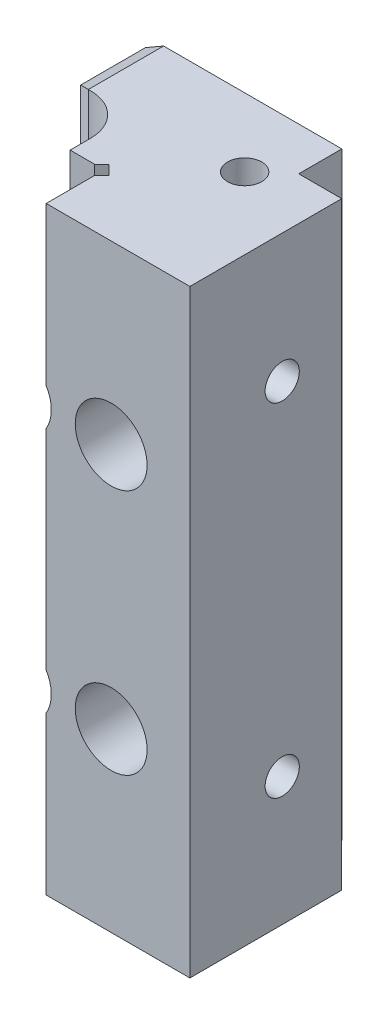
ISO-10303-21;
HEADER;
FILE_DESCRIPTION(('STEP AP214'),'2;1');
FILE_NAME('part.step','',(''),(''),'','','');
FILE_SCHEMA(('AUTOMOTIVE_DESIGN { 1 0 10303 214 1 1 1 1 }'));
ENDSEC;
DATA;
#1=APPLICATION_CONTEXT('core data for automotive mechanical design processes');
#2=APPLICATION_PROTOCOL_DEFINITION('international standard','automotive_design',2000,#1);
#3=PRODUCT_CONTEXT('',#1,'mechanical');
#4=PRODUCT('Part','Part','',(#3));
#5=PRODUCT_RELATED_PRODUCT_CATEGORY('part','',(#4));
#6=PRODUCT_DEFINITION_FORMATION('','',#4);
#7=PRODUCT_DEFINITION_CONTEXT('part definition',#1,'design');
#8=PRODUCT_DEFINITION('design','',#6,#7);
#9=PRODUCT_DEFINITION_SHAPE('','',#8);
#10=(LENGTH_UNIT() NAMED_UNIT(*) SI_UNIT(.MILLI.,.METRE.));
#11=(NAMED_UNIT(*) PLANE_ANGLE_UNIT() SI_UNIT($,.RADIAN.));
#12=(NAMED_UNIT(*) SI_UNIT($,.STERADIAN.) SOLID_ANGLE_UNIT());
#13=UNCERTAINTY_MEASURE_WITH_UNIT(LENGTH_MEASURE(1.E-05),#10,'distance_accuracy_value','');
#14=(GEOMETRIC_REPRESENTATION_CONTEXT(3) GLOBAL_UNCERTAINTY_ASSIGNED_CONTEXT((#13)) GLOBAL_UNIT_ASSIGNED_CONTEXT((#10,
#11,#12)) REPRESENTATION_CONTEXT('',''));
#15=CARTESIAN_POINT('',(0.,0.,0.));
#16=DIRECTION('',(0.,0.,1.));
#17=DIRECTION('',(1.,0.,0.));
#18=AXIS2_PLACEMENT_3D('',#15,#16,#17);
#19=CARTESIAN_POINT('',(8.50000000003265,-7.,15.));
#20=DIRECTION('',(1.,0.,0.));
#21=DIRECTION('',(0.,1.,0.));
#22=AXIS2_PLACEMENT_3D('',#19,#20,#21);
#23=CONICAL_SURFACE('',#22,2.50000000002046,1.22173047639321);
#24=CARTESIAN_POINT('',(7.5900744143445,-7.00000000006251,15.));
#25=VERTEX_POINT('',#24);
#26=VERTEX_LOOP('',#25);
#27=FACE_BOUND('',#26,.T.);
#28=CARTESIAN_POINT('',(8.4999999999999,-7.,15.));
#29=DIRECTION('',(1.,0.,0.));
#30=DIRECTION('',(0.,1.,0.));
#31=AXIS2_PLACEMENT_3D('',#28,#29,#30);
#32=CIRCLE('',#31,2.5);
#33=CARTESIAN_POINT('',(8.49999999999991,-4.5,15.));
#34=VERTEX_POINT('',#33);
#35=EDGE_CURVE('E506',#34,#34,#32,.T.);
#36=ORIENTED_EDGE('',*,*,#35,.T.);
#37=EDGE_LOOP('',(#36));
#38=FACE_BOUND('',#37,.T.);
#39=ADVANCED_FACE('F17',(#27,#38),#23,.F.);
#40=CARTESIAN_POINT('',(25.5,-7.,15.));
#41=DIRECTION('',(1.,0.,0.));
#42=DIRECTION('',(0.,1.,0.));
#43=AXIS2_PLACEMENT_3D('',#40,#41,#42);
#44=CYLINDRICAL_SURFACE('',#43,2.5);
#45=ORIENTED_EDGE('',*,*,#35,.F.);
#46=EDGE_LOOP('',(#45));
#47=FACE_BOUND('',#46,.T.);
#48=CARTESIAN_POINT('',(25.4878378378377,-7.,15.));
#49=DIRECTION('',(-0.99999959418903,0.,0.000900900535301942));
#50=DIRECTION('',(0.000900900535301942,0.,0.99999959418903));
#51=AXIS2_PLACEMENT_3D('',#48,#49,#50);
#52=ELLIPSE('',#51,2.50000101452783,2.5);
#53=CARTESIAN_POINT('',(25.49009009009,-7.,17.5));
#54=VERTEX_POINT('',#53);
#55=EDGE_CURVE('E1110',#54,#54,#52,.F.);
#56=ORIENTED_EDGE('',*,*,#55,.T.);
#57=EDGE_LOOP('',(#56));
#58=FACE_BOUND('',#57,.T.);
#59=ADVANCED_FACE('F19',(#47,#58),#44,.F.);
#60=CARTESIAN_POINT('',(25.5,61.750025,28.5));
#61=DIRECTION('',(-0.99999959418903,0.,0.000900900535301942));
#62=DIRECTION('',(-0.000900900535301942,0.,-0.99999959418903));
#63=AXIS2_PLACEMENT_3D('',#60,#61,#62);
#64=PLANE('',#63);
#65=ORIENTED_EDGE('',*,*,#55,.F.);
#66=EDGE_LOOP('',(#65));
#67=FACE_BOUND('',#66,.T.);
#68=DIRECTION('',(-0.000900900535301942,0.,-0.99999959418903));
#69=VECTOR('',#68,1.);
#70=CARTESIAN_POINT('',(25.5,61.75,28.5));
#71=LINE('',#70,#69);
#72=CARTESIAN_POINT('',(25.5,61.75,28.5));
#73=VERTEX_POINT('',#72);
#74=CARTESIAN_POINT('',(25.48,61.75,6.29999999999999));
#75=VERTEX_POINT('',#74);
#76=EDGE_CURVE('E931',#73,#75,#71,.T.);
#77=ORIENTED_EDGE('',*,*,#76,.F.);
#78=DIRECTION('',(0.,1.,0.));
#79=VECTOR('',#78,1.);
#80=CARTESIAN_POINT('',(25.5,61.750025,28.5));
#81=LINE('',#80,#79);
#82=CARTESIAN_POINT('',(25.5,-25.75,28.5));
#83=VERTEX_POINT('',#82);
#84=EDGE_CURVE('E890',#83,#73,#81,.T.);
#85=ORIENTED_EDGE('',*,*,#84,.F.);
#86=DIRECTION('',(-0.000900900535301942,0.,-0.99999959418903));
#87=VECTOR('',#86,1.);
#88=CARTESIAN_POINT('',(25.4743243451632,-25.75,2.31312206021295E-05));
#89=LINE('',#88,#87);
#90=CARTESIAN_POINT('',(25.48,-25.75,6.3));
#91=VERTEX_POINT('',#90);
#92=EDGE_CURVE('E871',#83,#91,#89,.T.);
#93=ORIENTED_EDGE('',*,*,#92,.T.);
#94=DIRECTION('',(0.,1.,0.));
#95=VECTOR('',#94,1.);
#96=CARTESIAN_POINT('',(25.48,61.750025,6.29999999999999));
#97=LINE('',#96,#95);
#98=EDGE_CURVE('E893',#75,#91,#97,.F.);
#99=ORIENTED_EDGE('',*,*,#98,.F.);
#100=EDGE_LOOP('',(#77,#85,#93,#99));
#101=FACE_BOUND('',#100,.T.);
#102=CARTESIAN_POINT('',(25.487837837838,43.,15.));
#103=DIRECTION('',(-0.99999959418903,0.,0.000900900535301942));
#104=DIRECTION('',(0.000900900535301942,0.,0.99999959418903));
#105=AXIS2_PLACEMENT_3D('',#102,#103,#104);
#106=ELLIPSE('',#105,2.50000101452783,2.5);
#107=CARTESIAN_POINT('',(25.4900900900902,43.,17.5));
#108=VERTEX_POINT('',#107);
#109=EDGE_CURVE('E11',#108,#108,#106,.T.);
#110=ORIENTED_EDGE('',*,*,#109,.T.);
#111=EDGE_LOOP('',(#110));
#112=FACE_BOUND('',#111,.T.);
#113=ADVANCED_FACE('F714',(#67,#101,#112),#64,.F.);
#114=CARTESIAN_POINT('',(19.5,18.,-3.5));
#115=DIRECTION('',(0.,0.,1.));
#116=DIRECTION('',(0.,1.,0.));
#117=AXIS2_PLACEMENT_3D('',#114,#115,#116);
#118=PLANE('',#117);
#119=CARTESIAN_POINT('',(0.,0.,-3.50000000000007));
#120=DIRECTION('',(0.,0.,1.));
#121=DIRECTION('',(0.,1.,0.));
#122=AXIS2_PLACEMENT_3D('',#119,#120,#121);
#123=CIRCLE('',#122,3.25);
#124=CARTESIAN_POINT('',(0.,3.25000000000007,-3.50000000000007));
#125=VERTEX_POINT('',#124);
#126=EDGE_CURVE('E1127',#125,#125,#123,.T.);
#127=ORIENTED_EDGE('',*,*,#126,.T.);
#128=EDGE_LOOP('',(#127));
#129=FACE_BOUND('',#128,.T.);
#130=CARTESIAN_POINT('',(1.2490009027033E-13,36.,-3.50000000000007));
#131=DIRECTION('',(0.,0.,1.));
#132=DIRECTION('',(0.,1.,0.));
#133=AXIS2_PLACEMENT_3D('',#130,#131,#132);
#134=CIRCLE('',#133,3.25);
#135=CARTESIAN_POINT('',(1.3624740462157E-13,39.25,-3.50000000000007));
#136=VERTEX_POINT('',#135);
#137=EDGE_CURVE('E510',#136,#136,#134,.F.);
#138=ORIENTED_EDGE('',*,*,#137,.F.);
#139=EDGE_LOOP('',(#138));
#140=FACE_BOUND('',#139,.T.);
#141=DIRECTION('',(-0.707106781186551,-0.707106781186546,0.));
#142=VECTOR('',#141,1.);
#143=CARTESIAN_POINT('',(22.725,14.775,-3.5));
#144=LINE('',#143,#142);
#145=CARTESIAN_POINT('',(5.,-2.94999999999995,-3.50000000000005));
#146=VERTEX_POINT('',#145);
#147=CARTESIAN_POINT('',(4.,-3.94999999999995,-3.50000000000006));
#148=VERTEX_POINT('',#147);
#149=EDGE_CURVE('E1154',#146,#148,#144,.T.);
#150=ORIENTED_EDGE('',*,*,#149,.T.);
#151=DIRECTION('',(-1.,0.,0.));
#152=VECTOR('',#151,1.);
#153=CARTESIAN_POINT('',(19.5,-3.95,-3.5));
#154=LINE('',#153,#152);
#155=CARTESIAN_POINT('',(-4.,-3.94999999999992,-3.50000000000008));
#156=VERTEX_POINT('',#155);
#157=EDGE_CURVE('E1158',#148,#156,#154,.T.);
#158=ORIENTED_EDGE('',*,*,#157,.T.);
#159=DIRECTION('',(-0.707106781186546,0.707106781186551,0.));
#160=VECTOR('',#159,1.);
#161=CARTESIAN_POINT('',(-3.22499999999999,-4.72499999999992,-3.50000000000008));
#162=LINE('',#161,#160);
#163=CARTESIAN_POINT('',(-4.99999999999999,-2.94999999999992,-3.50000000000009));
#164=VERTEX_POINT('',#163);
#165=EDGE_CURVE('E1131',#156,#164,#162,.T.);
#166=ORIENTED_EDGE('',*,*,#165,.T.);
#167=DIRECTION('',(0.,1.,0.));
#168=VECTOR('',#167,1.);
#169=CARTESIAN_POINT('',(-4.99999999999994,18.,-3.50000000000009));
#170=LINE('',#169,#168);
#171=CARTESIAN_POINT('',(-4.99999999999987,38.95,-3.50000000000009));
#172=VERTEX_POINT('',#171);
#173=EDGE_CURVE('E1135',#164,#172,#170,.T.);
#174=ORIENTED_EDGE('',*,*,#173,.T.);
#175=DIRECTION('',(0.707106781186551,0.707106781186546,0.));
#176=VECTOR('',#175,1.);
#177=CARTESIAN_POINT('',(-3.22499999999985,40.725,-3.50000000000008));
#178=LINE('',#177,#176);
#179=CARTESIAN_POINT('',(-3.99999999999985,39.95,-3.50000000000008));
#180=VERTEX_POINT('',#179);
#181=EDGE_CURVE('E1139',#172,#180,#178,.T.);
#182=ORIENTED_EDGE('',*,*,#181,.T.);
#183=DIRECTION('',(1.,0.,0.));
#184=VECTOR('',#183,1.);
#185=CARTESIAN_POINT('',(19.5,39.95,-3.5));
#186=LINE('',#185,#184);
#187=CARTESIAN_POINT('',(4.00000000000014,39.95,-3.50000000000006));
#188=VERTEX_POINT('',#187);
#189=EDGE_CURVE('E1143',#180,#188,#186,.T.);
#190=ORIENTED_EDGE('',*,*,#189,.T.);
#191=DIRECTION('',(0.707106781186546,-0.707106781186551,0.));
#192=VECTOR('',#191,1.);
#193=CARTESIAN_POINT('',(22.725,21.225,-3.5));
#194=LINE('',#193,#192);
#195=CARTESIAN_POINT('',(5.00000000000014,38.95,-3.50000000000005));
#196=VERTEX_POINT('',#195);
#197=EDGE_CURVE('E1147',#188,#196,#194,.T.);
#198=ORIENTED_EDGE('',*,*,#197,.T.);
#199=DIRECTION('',(0.,-1.,0.));
#200=VECTOR('',#199,1.);
#201=CARTESIAN_POINT('',(5.00000000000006,18.,-3.50000000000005));
#202=LINE('',#201,#200);
#203=EDGE_CURVE('E1151',#196,#146,#202,.T.);
#204=ORIENTED_EDGE('',*,*,#203,.T.);
#205=EDGE_LOOP('',(#150,#158,#166,#174,#182,#190,#198,#204));
#206=FACE_BOUND('',#205,.T.);
#207=ADVANCED_FACE('F630',(#129,#140,#206),#118,.F.);
#208=CARTESIAN_POINT('',(0.,36.,28.5));
#209=DIRECTION('',(0.,0.,1.));
#210=DIRECTION('',(-1.,0.,0.));
#211=AXIS2_PLACEMENT_3D('',#208,#209,#210);
#212=CYLINDRICAL_SURFACE('',#211,5.25);
#213=DIRECTION('',(0.,0.,1.));
#214=VECTOR('',#213,1.);
#215=CARTESIAN_POINT('',(4.5,33.2958365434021,28.5));
#216=LINE('',#215,#214);
#217=CARTESIAN_POINT('',(4.49999999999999,33.2958365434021,21.4142135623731));
#218=VERTEX_POINT('',#217);
#219=CARTESIAN_POINT('',(4.5,33.2958365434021,28.5));
#220=VERTEX_POINT('',#219);
#221=EDGE_CURVE('E493',#218,#220,#216,.T.);
#222=ORIENTED_EDGE('',*,*,#221,.T.);
#223=CARTESIAN_POINT('',(0.,36.,28.5));
#224=DIRECTION('',(0.,0.,1.));
#225=DIRECTION('',(0.,1.,0.));
#226=AXIS2_PLACEMENT_3D('',#223,#224,#225);
#227=CIRCLE('',#226,5.25);
#228=CARTESIAN_POINT('',(4.5,38.7041634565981,28.5));
#229=VERTEX_POINT('',#228);
#230=EDGE_CURVE('E675',#220,#229,#227,.T.);
#231=ORIENTED_EDGE('',*,*,#230,.T.);
#232=DIRECTION('',(0.,0.,1.));
#233=VECTOR('',#232,1.);
#234=CARTESIAN_POINT('',(4.5,38.7041634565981,28.5));
#235=LINE('',#234,#233);
#236=CARTESIAN_POINT('',(4.49999999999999,38.7041634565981,21.4142135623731));
#237=VERTEX_POINT('',#236);
#238=EDGE_CURVE('E502',#229,#237,#235,.F.);
#239=ORIENTED_EDGE('',*,*,#238,.T.);
#240=CARTESIAN_POINT('',(0.,36.,25.9142135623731));
#241=DIRECTION('',(0.70710678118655,0.,0.707106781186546));
#242=DIRECTION('',(-0.707106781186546,0.,0.70710678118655));
#243=AXIS2_PLACEMENT_3D('',#240,#241,#242);
#244=ELLIPSE('',#243,7.4246212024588,5.25);
#245=EDGE_CURVE('E461',#237,#218,#244,.F.);
#246=ORIENTED_EDGE('',*,*,#245,.T.);
#247=EDGE_LOOP('',(#222,#231,#239,#246));
#248=FACE_BOUND('',#247,.T.);
#249=ADVANCED_FACE('F626',(#248),#212,.F.);
#250=CARTESIAN_POINT('',(4.5000000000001,61.75,28.5));
#251=DIRECTION('',(1.,0.,0.));
#252=DIRECTION('',(0.,1.,0.));
#253=AXIS2_PLACEMENT_3D('',#250,#251,#252);
#254=PLANE('',#253);
#255=DIRECTION('',(0.,-1.,0.));
#256=VECTOR('',#255,1.);
#257=CARTESIAN_POINT('',(4.5000000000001,61.75,28.5));
#258=LINE('',#257,#256);
#259=CARTESIAN_POINT('',(4.49999999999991,2.70416345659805,28.5));
#260=VERTEX_POINT('',#259);
#261=EDGE_CURVE('E1059',#220,#260,#258,.T.);
#262=ORIENTED_EDGE('',*,*,#261,.F.);
#263=ORIENTED_EDGE('',*,*,#221,.F.);
#264=DIRECTION('',(0.,-1.,0.));
#265=VECTOR('',#264,1.);
#266=CARTESIAN_POINT('',(4.49999999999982,-25.75,21.414213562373));
#267=LINE('',#266,#265);
#268=CARTESIAN_POINT('',(4.49999999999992,2.70416345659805,21.414213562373));
#269=VERTEX_POINT('',#268);
#270=EDGE_CURVE('E458',#218,#269,#267,.T.);
#271=ORIENTED_EDGE('',*,*,#270,.T.);
#272=DIRECTION('',(0.,0.,1.));
#273=VECTOR('',#272,1.);
#274=CARTESIAN_POINT('',(4.49999999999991,2.70416345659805,28.5));
#275=LINE('',#274,#273);
#276=EDGE_CURVE('E497',#269,#260,#275,.T.);
#277=ORIENTED_EDGE('',*,*,#276,.T.);
#278=EDGE_LOOP('',(#262,#263,#271,#277));
#279=FACE_BOUND('',#278,.T.);
#280=ADVANCED_FACE('F622',(#279),#254,.F.);
#281=CARTESIAN_POINT('',(-1.11022302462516E-13,0.,28.5));
#282=DIRECTION('',(0.,0.,1.));
#283=DIRECTION('',(-1.,0.,0.));
#284=AXIS2_PLACEMENT_3D('',#281,#282,#283);
#285=CYLINDRICAL_SURFACE('',#284,5.25);
#286=DIRECTION('',(0.,0.,1.));
#287=VECTOR('',#286,1.);
#288=CARTESIAN_POINT('',(4.49999999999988,-2.70416345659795,28.5));
#289=LINE('',#288,#287);
#290=CARTESIAN_POINT('',(4.49999999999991,-2.70416345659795,21.4142135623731));
#291=VERTEX_POINT('',#290);
#292=CARTESIAN_POINT('',(4.49999999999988,-2.70416345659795,28.5));
#293=VERTEX_POINT('',#292);
#294=EDGE_CURVE('E471',#291,#293,#289,.T.);
#295=ORIENTED_EDGE('',*,*,#294,.T.);
#296=CARTESIAN_POINT('',(-1.11022302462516E-13,0.,28.5));
#297=DIRECTION('',(0.,0.,1.));
#298=DIRECTION('',(0.,1.,0.));
#299=AXIS2_PLACEMENT_3D('',#296,#297,#298);
#300=CIRCLE('',#299,5.25);
#301=EDGE_CURVE('E1817',#293,#260,#300,.T.);
#302=ORIENTED_EDGE('',*,*,#301,.T.);
#303=ORIENTED_EDGE('',*,*,#276,.F.);
#304=CARTESIAN_POINT('',(0.,0.,25.9142135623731));
#305=DIRECTION('',(0.70710678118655,0.,0.707106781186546));
#306=DIRECTION('',(-0.707106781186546,0.,0.70710678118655));
#307=AXIS2_PLACEMENT_3D('',#304,#305,#306);
#308=ELLIPSE('',#307,7.42462120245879,5.25);
#309=EDGE_CURVE('E455',#269,#291,#308,.F.);
#310=ORIENTED_EDGE('',*,*,#309,.T.);
#311=EDGE_LOOP('',(#295,#302,#303,#310));
#312=FACE_BOUND('',#311,.T.);
#313=ADVANCED_FACE('F618',(#312),#285,.F.);
#314=CARTESIAN_POINT('',(-15.5,61.75,20.));
#315=DIRECTION('',(0.,0.,-1.));
#316=DIRECTION('',(1.,0.,0.));
#317=AXIS2_PLACEMENT_3D('',#314,#315,#316);
#318=PLANE('',#317);
#319=DIRECTION('',(0.,1.,0.));
#320=VECTOR('',#319,1.);
#321=CARTESIAN_POINT('',(-0.499999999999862,61.75,20.));
#322=LINE('',#321,#320);
#323=CARTESIAN_POINT('',(-0.499999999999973,30.7738637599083,20.));
#324=VERTEX_POINT('',#323);
#325=CARTESIAN_POINT('',(-0.50000000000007,5.22613624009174,20.));
#326=VERTEX_POINT('',#325);
#327=EDGE_CURVE('E1068',#324,#326,#322,.F.);
#328=ORIENTED_EDGE('',*,*,#327,.T.);
#329=CARTESIAN_POINT('',(0.,0.,20.));
#330=DIRECTION('',(0.,0.,-1.));
#331=DIRECTION('',(1.,0.,0.));
#332=AXIS2_PLACEMENT_3D('',#329,#330,#331);
#333=CIRCLE('',#332,5.25);
#334=CARTESIAN_POINT('',(3.08578643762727,4.24740180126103,20.));
#335=VERTEX_POINT('',#334);
#336=EDGE_CURVE('E1854',#335,#326,#333,.F.);
#337=ORIENTED_EDGE('',*,*,#336,.F.);
#338=DIRECTION('',(0.,-1.,0.));
#339=VECTOR('',#338,1.);
#340=CARTESIAN_POINT('',(3.08578643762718,-25.75,20.));
#341=LINE('',#340,#339);
#342=CARTESIAN_POINT('',(3.08578643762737,31.7525981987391,20.));
#343=VERTEX_POINT('',#342);
#344=EDGE_CURVE('E434',#335,#343,#341,.F.);
#345=ORIENTED_EDGE('',*,*,#344,.T.);
#346=CARTESIAN_POINT('',(0.,36.,20.));
#347=DIRECTION('',(0.,0.,-1.));
#348=DIRECTION('',(1.,0.,0.));
#349=AXIS2_PLACEMENT_3D('',#346,#347,#348);
#350=CIRCLE('',#349,5.25);
#351=EDGE_CURVE('E987',#324,#343,#350,.F.);
#352=ORIENTED_EDGE('',*,*,#351,.F.);
#353=EDGE_LOOP('',(#328,#337,#345,#352));
#354=FACE_BOUND('',#353,.T.);
#355=ADVANCED_FACE('F614',(#354),#318,.F.);
#356=CARTESIAN_POINT('',(-0.499999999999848,61.75,11.));
#357=DIRECTION('',(1.,0.,0.));
#358=DIRECTION('',(0.,0.,1.));
#359=AXIS2_PLACEMENT_3D('',#356,#357,#358);
#360=PLANE('',#359);
#361=DIRECTION('',(0.,0.,1.));
#362=VECTOR('',#361,1.);
#363=CARTESIAN_POINT('',(-0.5,30.7738637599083,28.5));
#364=LINE('',#363,#362);
#365=CARTESIAN_POINT('',(-0.499999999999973,30.7738637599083,17.));
#366=VERTEX_POINT('',#365);
#367=EDGE_CURVE('E986',#324,#366,#364,.F.);
#368=ORIENTED_EDGE('',*,*,#367,.T.);
#369=DIRECTION('',(0.,1.,0.));
#370=VECTOR('',#369,1.);
#371=CARTESIAN_POINT('',(-0.500000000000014,18.,17.));
#372=LINE('',#371,#370);
#373=CARTESIAN_POINT('',(-0.500000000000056,5.22613624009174,17.));
#374=VERTEX_POINT('',#373);
#375=EDGE_CURVE('E407',#366,#374,#372,.F.);
#376=ORIENTED_EDGE('',*,*,#375,.T.);
#377=DIRECTION('',(0.,0.,1.));
#378=VECTOR('',#377,1.);
#379=CARTESIAN_POINT('',(-0.500000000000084,5.22613624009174,28.5));
#380=LINE('',#379,#378);
#381=EDGE_CURVE('E659',#326,#374,#380,.F.);
#382=ORIENTED_EDGE('',*,*,#381,.F.);
#383=ORIENTED_EDGE('',*,*,#327,.F.);
#384=EDGE_LOOP('',(#368,#376,#382,#383));
#385=FACE_BOUND('',#384,.T.);
#386=ADVANCED_FACE('F604',(#385),#360,.F.);
#387=CARTESIAN_POINT('',(0.,-5.24999999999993,4.49999999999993));
#388=DIRECTION('',(0.,0.,-1.));
#389=DIRECTION('',(1.,0.,0.));
#390=AXIS2_PLACEMENT_3D('',#387,#388,#389);
#391=PLANE('',#390);
#392=CARTESIAN_POINT('',(0.,0.,4.49999999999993));
#393=DIRECTION('',(0.,0.,1.));
#394=DIRECTION('',(-1.,0.,0.));
#395=AXIS2_PLACEMENT_3D('',#392,#393,#394);
#396=CIRCLE('',#395,5.25);
#397=CARTESIAN_POINT('',(-5.25000000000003,0.,4.49999999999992));
#398=VERTEX_POINT('',#397);
#399=EDGE_CURVE('E1085',#398,#398,#396,.T.);
#400=ORIENTED_EDGE('',*,*,#399,.T.);
#401=EDGE_LOOP('',(#400));
#402=FACE_BOUND('',#401,.T.);
#403=CARTESIAN_POINT('',(0.,0.,4.49999999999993));
#404=DIRECTION('',(0.,0.,1.));
#405=DIRECTION('',(-1.,0.,0.));
#406=AXIS2_PLACEMENT_3D('',#403,#404,#405);
#407=CIRCLE('',#406,3.25);
#408=CARTESIAN_POINT('',(-3.25000000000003,0.,4.49999999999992));
#409=VERTEX_POINT('',#408);
#410=EDGE_CURVE('E492',#409,#409,#407,.F.);
#411=ORIENTED_EDGE('',*,*,#410,.T.);
#412=EDGE_LOOP('',(#411));
#413=FACE_BOUND('',#412,.T.);
#414=ADVANCED_FACE('F600',(#402,#413),#391,.F.);
#415=CARTESIAN_POINT('',(0.,30.75,4.49999999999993));
#416=DIRECTION('',(0.,0.,-1.));
#417=DIRECTION('',(1.,0.,0.));
#418=AXIS2_PLACEMENT_3D('',#415,#416,#417);
#419=PLANE('',#418);
#420=CARTESIAN_POINT('',(0.,36.,4.49999999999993));
#421=DIRECTION('',(0.,0.,1.));
#422=DIRECTION('',(-1.,0.,0.));
#423=AXIS2_PLACEMENT_3D('',#420,#421,#422);
#424=CIRCLE('',#423,5.25);
#425=CARTESIAN_POINT('',(-5.2499999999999,36.,4.49999999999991));
#426=VERTEX_POINT('',#425);
#427=EDGE_CURVE('E425',#426,#426,#424,.T.);
#428=ORIENTED_EDGE('',*,*,#427,.T.);
#429=EDGE_LOOP('',(#428));
#430=FACE_BOUND('',#429,.T.);
#431=CARTESIAN_POINT('',(0.,36.,4.49999999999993));
#432=DIRECTION('',(0.,0.,1.));
#433=DIRECTION('',(-1.,0.,0.));
#434=AXIS2_PLACEMENT_3D('',#431,#432,#433);
#435=CIRCLE('',#434,3.25);
#436=CARTESIAN_POINT('',(-3.2499999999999,36.,4.49999999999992));
#437=VERTEX_POINT('',#436);
#438=EDGE_CURVE('E386',#437,#437,#435,.F.);
#439=ORIENTED_EDGE('',*,*,#438,.T.);
#440=EDGE_LOOP('',(#439));
#441=FACE_BOUND('',#440,.T.);
#442=ADVANCED_FACE('F596',(#430,#441),#419,.F.);
#443=CARTESIAN_POINT('',(-0.499999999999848,61.75,11.));
#444=DIRECTION('',(1.,0.,0.));
#445=DIRECTION('',(0.,0.,1.));
#446=AXIS2_PLACEMENT_3D('',#443,#444,#445);
#447=PLANE('',#446);
#448=DIRECTION('',(0.,0.,1.));
#449=VECTOR('',#448,1.);
#450=CARTESIAN_POINT('',(-0.499999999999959,41.2261362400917,28.5));
#451=LINE('',#450,#449);
#452=CARTESIAN_POINT('',(-0.499999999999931,41.2261362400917,20.));
#453=VERTEX_POINT('',#452);
#454=CARTESIAN_POINT('',(-0.499999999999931,41.2261362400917,17.));
#455=VERTEX_POINT('',#454);
#456=EDGE_CURVE('E982',#453,#455,#451,.F.);
#457=ORIENTED_EDGE('',*,*,#456,.F.);
#458=DIRECTION('',(0.,1.,0.));
#459=VECTOR('',#458,1.);
#460=CARTESIAN_POINT('',(-0.499999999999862,61.75,20.));
#461=LINE('',#460,#459);
#462=CARTESIAN_POINT('',(-0.499999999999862,61.75,20.));
#463=VERTEX_POINT('',#462);
#464=EDGE_CURVE('E1002',#463,#453,#461,.F.);
#465=ORIENTED_EDGE('',*,*,#464,.F.);
#466=DIRECTION('',(0.,0.,-1.));
#467=VECTOR('',#466,1.);
#468=CARTESIAN_POINT('',(-0.499999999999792,61.75,0.));
#469=LINE('',#468,#467);
#470=CARTESIAN_POINT('',(-0.499999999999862,61.75,17.));
#471=VERTEX_POINT('',#470);
#472=EDGE_CURVE('E949',#463,#471,#469,.T.);
#473=ORIENTED_EDGE('',*,*,#472,.T.);
#474=DIRECTION('',(0.,1.,0.));
#475=VECTOR('',#474,1.);
#476=CARTESIAN_POINT('',(-0.500000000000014,18.,17.));
#477=LINE('',#476,#475);
#478=EDGE_CURVE('E398',#471,#455,#477,.F.);
#479=ORIENTED_EDGE('',*,*,#478,.T.);
#480=EDGE_LOOP('',(#457,#465,#473,#479));
#481=FACE_BOUND('',#480,.T.);
#482=ADVANCED_FACE('F592',(#481),#447,.F.);
#483=CARTESIAN_POINT('',(-15.5,61.75,20.));
#484=DIRECTION('',(0.,0.,-1.));
#485=DIRECTION('',(1.,0.,0.));
#486=AXIS2_PLACEMENT_3D('',#483,#484,#485);
#487=PLANE('',#486);
#488=ORIENTED_EDGE('',*,*,#464,.T.);
#489=CARTESIAN_POINT('',(0.,36.,20.));
#490=DIRECTION('',(0.,0.,-1.));
#491=DIRECTION('',(1.,0.,0.));
#492=AXIS2_PLACEMENT_3D('',#489,#490,#491);
#493=CIRCLE('',#492,5.25);
#494=CARTESIAN_POINT('',(3.08578643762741,40.247401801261,20.));
#495=VERTEX_POINT('',#494);
#496=EDGE_CURVE('E967',#495,#453,#493,.F.);
#497=ORIENTED_EDGE('',*,*,#496,.F.);
#498=DIRECTION('',(0.,-1.,0.));
#499=VECTOR('',#498,1.);
#500=CARTESIAN_POINT('',(3.08578643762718,-25.75,20.));
#501=LINE('',#500,#499);
#502=CARTESIAN_POINT('',(3.08578643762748,61.75,20.));
#503=VERTEX_POINT('',#502);
#504=EDGE_CURVE('E414',#495,#503,#501,.F.);
#505=ORIENTED_EDGE('',*,*,#504,.T.);
#506=DIRECTION('',(-1.,0.,0.));
#507=VECTOR('',#506,1.);
#508=CARTESIAN_POINT('',(25.5,61.75,20.));
#509=LINE('',#508,#507);
#510=EDGE_CURVE('E943',#503,#463,#509,.T.);
#511=ORIENTED_EDGE('',*,*,#510,.T.);
#512=EDGE_LOOP('',(#488,#497,#505,#511));
#513=FACE_BOUND('',#512,.T.);
#514=ADVANCED_FACE('F588',(#513),#487,.F.);
#515=CARTESIAN_POINT('',(4.5000000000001,61.75,28.5));
#516=DIRECTION('',(1.,0.,0.));
#517=DIRECTION('',(0.,1.,0.));
#518=AXIS2_PLACEMENT_3D('',#515,#516,#517);
#519=PLANE('',#518);
#520=ORIENTED_EDGE('',*,*,#238,.F.);
#521=DIRECTION('',(0.,-1.,0.));
#522=VECTOR('',#521,1.);
#523=CARTESIAN_POINT('',(4.5000000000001,61.75,28.5));
#524=LINE('',#523,#522);
#525=CARTESIAN_POINT('',(4.5000000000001,61.75,28.5));
#526=VERTEX_POINT('',#525);
#527=EDGE_CURVE('E1025',#526,#229,#524,.T.);
#528=ORIENTED_EDGE('',*,*,#527,.F.);
#529=DIRECTION('',(0.,0.,1.));
#530=VECTOR('',#529,1.);
#531=CARTESIAN_POINT('',(4.5000000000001,61.75,28.5));
#532=LINE('',#531,#530);
#533=CARTESIAN_POINT('',(4.50000000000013,61.75,21.4142135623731));
#534=VERTEX_POINT('',#533);
#535=EDGE_CURVE('E907',#534,#526,#532,.T.);
#536=ORIENTED_EDGE('',*,*,#535,.F.);
#537=DIRECTION('',(0.,-1.,0.));
#538=VECTOR('',#537,1.);
#539=CARTESIAN_POINT('',(4.49999999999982,-25.75,21.414213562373));
#540=LINE('',#539,#538);
#541=EDGE_CURVE('E462',#534,#237,#540,.T.);
#542=ORIENTED_EDGE('',*,*,#541,.T.);
#543=EDGE_LOOP('',(#520,#528,#536,#542));
#544=FACE_BOUND('',#543,.T.);
#545=ADVANCED_FACE('F585',(#544),#519,.F.);
#546=CARTESIAN_POINT('',(20.65,54.,6.3));
#547=DIRECTION('',(-0.707106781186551,0.,0.707106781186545));
#548=DIRECTION('',(-0.707106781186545,0.,-0.707106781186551));
#549=AXIS2_PLACEMENT_3D('',#546,#547,#548);
#550=PLANE('',#549);
#551=DIRECTION('',(0.,-1.,0.));
#552=VECTOR('',#551,1.);
#553=CARTESIAN_POINT('',(20.65,-25.75,6.3));
#554=LINE('',#553,#552);
#555=CARTESIAN_POINT('',(20.65,-18.,6.3));
#556=VERTEX_POINT('',#555);
#557=CARTESIAN_POINT('',(20.65,54.,6.3));
#558=VERTEX_POINT('',#557);
#559=EDGE_CURVE('E382',#556,#558,#554,.F.);
#560=ORIENTED_EDGE('',*,*,#559,.T.);
#561=DIRECTION('',(-0.707106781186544,0.,-0.707106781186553));
#562=VECTOR('',#561,1.);
#563=CARTESIAN_POINT('',(22.1171572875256,54.,7.76715728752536));
#564=LINE('',#563,#562);
#565=CARTESIAN_POINT('',(22.4,54.,8.05));
#566=VERTEX_POINT('',#565);
#567=EDGE_CURVE('E41',#558,#566,#564,.F.);
#568=ORIENTED_EDGE('',*,*,#567,.T.);
#569=DIRECTION('',(0.,-1.,0.));
#570=VECTOR('',#569,1.);
#571=CARTESIAN_POINT('',(22.4,54.,8.05));
#572=LINE('',#571,#570);
#573=CARTESIAN_POINT('',(22.4,-18.,8.05));
#574=VERTEX_POINT('',#573);
#575=EDGE_CURVE('E1166',#566,#574,#572,.T.);
#576=ORIENTED_EDGE('',*,*,#575,.T.);
#577=DIRECTION('',(-0.707106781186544,0.,-0.707106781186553));
#578=VECTOR('',#577,1.);
#579=CARTESIAN_POINT('',(22.1171572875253,-18.,7.76715728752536));
#580=LINE('',#579,#578);
#581=EDGE_CURVE('E33',#574,#556,#580,.T.);
#582=ORIENTED_EDGE('',*,*,#581,.T.);
#583=EDGE_LOOP('',(#560,#568,#576,#582));
#584=FACE_BOUND('',#583,.T.);
#585=ADVANCED_FACE('F581',(#584),#550,.F.);
#586=CARTESIAN_POINT('',(22.1171572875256,54.,-1.1));
#587=DIRECTION('',(1.,0.,0.));
#588=DIRECTION('',(0.,0.,1.));
#589=AXIS2_PLACEMENT_3D('',#586,#587,#588);
#590=CONICAL_SURFACE('',#589,8.86715728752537,0.78539816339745);
#591=CARTESIAN_POINT('',(20.65,54.,6.3));
#592=CARTESIAN_POINT('',(20.6499867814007,54.113702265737,6.3));
#593=CARTESIAN_POINT('',(20.6526202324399,54.227400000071,6.3));
#594=CARTESIAN_POINT('',(20.663082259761,54.4545386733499,6.30000000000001));
#595=CARTESIAN_POINT('',(20.6709100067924,54.5679796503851,6.30000000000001));
#596=CARTESIAN_POINT('',(20.6916425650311,54.7941763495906,6.30000000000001));
#597=CARTESIAN_POINT('',(20.704537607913,54.9069329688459,6.30000000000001));
#598=CARTESIAN_POINT('',(20.7352189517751,55.1317739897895,6.30000000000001));
#599=CARTESIAN_POINT('',(20.7530053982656,55.2438583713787,6.30000000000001));
#600=CARTESIAN_POINT('',(20.812726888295,55.5752791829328,6.30000000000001));
#601=CARTESIAN_POINT('',(20.8613735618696,55.7934324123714,6.30000000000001));
#602=CARTESIAN_POINT('',(20.9746128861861,56.2255824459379,6.3));
#603=CARTESIAN_POINT('',(21.0392127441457,56.4395773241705,6.3));
#604=CARTESIAN_POINT('',(21.1756384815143,56.8440637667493,6.3));
#605=CARTESIAN_POINT('',(21.2463067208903,57.0349498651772,6.30000000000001));
#606=CARTESIAN_POINT('',(21.3972347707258,57.4128351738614,6.30000000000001));
#607=CARTESIAN_POINT('',(21.4774932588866,57.5998349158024,6.30000000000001));
#608=CARTESIAN_POINT('',(21.6469641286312,57.9719935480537,6.30000000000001));
#609=CARTESIAN_POINT('',(21.7362587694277,58.1571147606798,6.30000000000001));
#610=CARTESIAN_POINT('',(21.9217824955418,58.523805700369,6.30000000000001));
#611=CARTESIAN_POINT('',(22.0180108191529,58.7053758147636,6.29999999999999));
#612=CARTESIAN_POINT('',(22.2257258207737,59.0823918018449,6.29999999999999));
#613=CARTESIAN_POINT('',(22.3377934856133,59.2775165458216,6.30000000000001));
#614=CARTESIAN_POINT('',(22.5677438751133,59.6643208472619,6.30000000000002));
#615=CARTESIAN_POINT('',(22.685627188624,59.8560000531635,6.30000000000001));
#616=CARTESIAN_POINT('',(22.9262904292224,60.2363692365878,6.30000000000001));
#617=CARTESIAN_POINT('',(23.0490724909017,60.4250578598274,6.30000000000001));
#618=CARTESIAN_POINT('',(23.2987175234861,60.7997207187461,6.30000000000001));
#619=CARTESIAN_POINT('',(23.4255806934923,60.9856948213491,6.30000000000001));
#620=CARTESIAN_POINT('',(23.8120078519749,61.5410261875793,6.30000000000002));
#621=CARTESIAN_POINT('',(24.076757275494,61.9067766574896,6.30000000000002));
#622=CARTESIAN_POINT('',(24.6162017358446,62.6306787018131,6.30000000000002));
#623=CARTESIAN_POINT('',(24.8908945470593,62.9888319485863,6.30000000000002));
#624=CARTESIAN_POINT('',(25.4326206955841,63.6798591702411,6.30000000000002));
#625=CARTESIAN_POINT('',(25.699255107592,64.0130467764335,6.30000000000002));
#626=CARTESIAN_POINT('',(26.2377778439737,64.6751780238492,6.30000000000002));
#627=CARTESIAN_POINT('',(26.5096665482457,65.0041213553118,6.30000000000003));
#628=CARTESIAN_POINT('',(27.0558338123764,65.6564459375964,6.30000000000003));
#629=CARTESIAN_POINT('',(27.3300860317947,65.9798492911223,6.30000000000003));
#630=CARTESIAN_POINT('',(27.8818818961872,66.6237500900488,6.30000000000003));
#631=CARTESIAN_POINT('',(28.1594250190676,66.9442479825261,6.30000000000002));
#632=CARTESIAN_POINT('',(28.4382593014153,67.263605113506,6.3));
#633=B_SPLINE_CURVE_WITH_KNOTS('',3,(#591,#592,#593,#594,#595,#596,#597,#598,#599,#600,#601,
#602,#603,#604,#605,#606,#607,#608,#609,#610,#611,#612,#613,#614,#615,#616,#617,#618,#619,#620,
#621,#622,#623,#624,#625,#626,#627,#628,#629,#630,#631,#632),.UNSPECIFIED.,.F.,.F.,(4,2,2,2,2,2,
2,2,2,2,2,2,2,2,2,2,2,2,2,2,4),(0.,0.341068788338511,0.682083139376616,1.02244331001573,
1.36281360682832,2.03259232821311,2.70267419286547,3.3130175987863,3.9232769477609,
4.53970091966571,5.15605727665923,5.83098707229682,6.50598534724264,7.18128103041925,
7.85660970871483,9.21088612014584,10.5648612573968,11.8450167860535,13.1252652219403,
14.3973399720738,15.6692155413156),.UNSPECIFIED.);
#634=CARTESIAN_POINT('',(22.3999999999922,59.381681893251,6.3));
#635=VERTEX_POINT('',#634);
#636=EDGE_CURVE('E385',#558,#635,#633,.T.);
#637=ORIENTED_EDGE('',*,*,#636,.T.);
#638=CARTESIAN_POINT('',(22.4,54.,-1.1));
#639=DIRECTION('',(1.,0.,0.));
#640=DIRECTION('',(0.,0.,1.));
#641=AXIS2_PLACEMENT_3D('',#638,#639,#640);
#642=CIRCLE('',#641,9.15);
#643=EDGE_CURVE('E1162',#635,#566,#642,.T.);
#644=ORIENTED_EDGE('',*,*,#643,.T.);
#645=ORIENTED_EDGE('',*,*,#567,.F.);
#646=EDGE_LOOP('',(#637,#644,#645));
#647=FACE_BOUND('',#646,.T.);
#648=ADVANCED_FACE('F576',(#647),#590,.F.);
#649=CARTESIAN_POINT('',(22.6828427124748,54.,-1.1));
#650=DIRECTION('',(-1.,0.,0.));
#651=DIRECTION('',(0.,-1.,0.));
#652=AXIS2_PLACEMENT_3D('',#649,#650,#651);
#653=CONICAL_SURFACE('',#652,8.86715728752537,0.785398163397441);
#654=DIRECTION('',(-0.707106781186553,0.,0.707106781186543));
#655=VECTOR('',#654,1.);
#656=CARTESIAN_POINT('',(22.6828427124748,54.,7.76715728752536));
#657=LINE('',#656,#655);
#658=CARTESIAN_POINT('',(24.15,54.,6.3));
#659=VERTEX_POINT('',#658);
#660=EDGE_CURVE('E477',#659,#566,#657,.T.);
#661=ORIENTED_EDGE('',*,*,#660,.T.);
#662=ORIENTED_EDGE('',*,*,#643,.F.);
#663=CARTESIAN_POINT('',(16.3617406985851,67.2636051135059,6.3));
#664=CARTESIAN_POINT('',(16.6370393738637,66.9482999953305,6.29999999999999));
#665=CARTESIAN_POINT('',(16.9110775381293,66.6318816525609,6.29999999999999));
#666=CARTESIAN_POINT('',(17.4559534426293,65.996222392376,6.29999999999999));
#667=CARTESIAN_POINT('',(17.7267907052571,65.6769810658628,6.29999999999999));
#668=CARTESIAN_POINT('',(18.2662114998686,65.0331340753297,6.3));
#669=CARTESIAN_POINT('',(18.5347697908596,64.7085072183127,6.3));
#670=CARTESIAN_POINT('',(19.0668112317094,64.0551478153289,6.3));
#671=CARTESIAN_POINT('',(19.330294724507,63.7264155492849,6.3));
#672=CARTESIAN_POINT('',(19.8727065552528,63.0359631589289,6.3));
#673=CARTESIAN_POINT('',(20.1510674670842,62.673795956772,6.3));
#674=CARTESIAN_POINT('',(20.697720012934,61.9417527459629,6.30000000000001));
#675=CARTESIAN_POINT('',(20.9660094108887,61.5718750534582,6.30000000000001));
#676=CARTESIAN_POINT('',(21.3575779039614,61.0102276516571,6.30000000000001));
#677=CARTESIAN_POINT('',(21.4861251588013,60.8221294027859,6.30000000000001));
#678=CARTESIAN_POINT('',(21.73906562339,60.4431652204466,6.30000000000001));
#679=CARTESIAN_POINT('',(21.8634590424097,60.252299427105,6.30000000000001));
#680=CARTESIAN_POINT('',(22.1072516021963,59.8675071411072,6.30000000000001));
#681=CARTESIAN_POINT('',(22.2266527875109,59.6735819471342,6.30000000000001));
#682=CARTESIAN_POINT('',(22.4595119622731,59.2822077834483,6.30000000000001));
#683=CARTESIAN_POINT('',(22.5729706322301,59.0847592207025,6.3));
#684=CARTESIAN_POINT('',(22.756394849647,58.7518302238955,6.3));
#685=CARTESIAN_POINT('',(22.8283396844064,58.6174411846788,6.30000000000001));
#686=CARTESIAN_POINT('',(22.9685664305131,58.3467686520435,6.30000000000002));
#687=CARTESIAN_POINT('',(23.03684831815,58.210485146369,6.30000000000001));
#688=CARTESIAN_POINT('',(23.2355188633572,57.7984961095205,6.30000000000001));
#689=CARTESIAN_POINT('',(23.3596907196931,57.5197266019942,6.30000000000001));
#690=CARTESIAN_POINT('',(23.5846508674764,56.9583378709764,6.30000000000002));
#691=CARTESIAN_POINT('',(23.6858021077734,56.6758655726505,6.30000000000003));
#692=CARTESIAN_POINT('',(23.8618197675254,56.1028859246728,6.30000000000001));
#693=CARTESIAN_POINT('',(23.9367112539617,55.8123865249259,6.29999999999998));
#694=CARTESIAN_POINT('',(24.0207406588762,55.3944987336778,6.3));
#695=CARTESIAN_POINT('',(24.0428911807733,55.2696581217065,6.30000000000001));
#696=CARTESIAN_POINT('',(24.0811858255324,55.0190684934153,6.30000000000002));
#697=CARTESIAN_POINT('',(24.09733101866,54.8933196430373,6.30000000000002));
#698=CARTESIAN_POINT('',(24.1234690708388,54.6398441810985,6.30000000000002));
#699=CARTESIAN_POINT('',(24.1333953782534,54.512110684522,6.30000000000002));
#700=CARTESIAN_POINT('',(24.1466726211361,54.256254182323,6.30000000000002));
#701=CARTESIAN_POINT('',(24.1500210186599,54.1281310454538,6.30000000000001));
#702=CARTESIAN_POINT('',(24.15,54.,6.3));
#703=B_SPLINE_CURVE_WITH_KNOTS('',3,(#663,#664,#665,#666,#667,#668,#669,#670,#671,#672,#673,
#674,#675,#676,#677,#678,#679,#680,#681,#682,#683,#684,#685,#686,#687,#688,#689,#690,#691,#692,
#693,#694,#695,#696,#697,#698,#699,#700,#701,#702),.UNSPECIFIED.,.F.,.F.,(4,2,2,2,2,2,2,2,2,2,2,
2,2,2,2,2,2,2,2,4),(0.,1.25574177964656,2.51166862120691,3.77557257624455,5.03939081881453,
6.40961726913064,7.78014615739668,8.46358551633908,9.14699039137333,9.83011258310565,
10.5131563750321,10.9704093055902,11.427665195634,12.34243283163,13.2415866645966,
14.1398798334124,14.5201337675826,14.9003199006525,15.2845080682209,15.6688444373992),.UNSPECIFIED.);
#704=EDGE_CURVE('E381',#635,#659,#703,.T.);
#705=ORIENTED_EDGE('',*,*,#704,.T.);
#706=EDGE_LOOP('',(#661,#662,#705));
#707=FACE_BOUND('',#706,.T.);
#708=ADVANCED_FACE('F571',(#707),#653,.F.);
#709=CARTESIAN_POINT('',(22.6828427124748,54.,7.76715728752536));
#710=DIRECTION('',(0.707106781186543,0.,0.707106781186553));
#711=DIRECTION('',(-0.707106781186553,0.,0.707106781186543));
#712=AXIS2_PLACEMENT_3D('',#709,#710,#711);
#713=PLANE('',#712);
#714=DIRECTION('',(0.707106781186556,0.,-0.70710678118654));
#715=VECTOR('',#714,1.);
#716=CARTESIAN_POINT('',(24.15,-18.,6.29999999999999));
#717=LINE('',#716,#715);
#718=CARTESIAN_POINT('',(24.15,-18.,6.29999999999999));
#719=VERTEX_POINT('',#718);
#720=EDGE_CURVE('E472',#719,#574,#717,.F.);
#721=ORIENTED_EDGE('',*,*,#720,.T.);
#722=ORIENTED_EDGE('',*,*,#575,.F.);
#723=ORIENTED_EDGE('',*,*,#660,.F.);
#724=DIRECTION('',(0.,-1.,0.));
#725=VECTOR('',#724,1.);
#726=CARTESIAN_POINT('',(24.15,-25.75,6.29999999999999));
#727=LINE('',#726,#725);
#728=EDGE_CURVE('E377',#659,#719,#727,.T.);
#729=ORIENTED_EDGE('',*,*,#728,.T.);
#730=EDGE_LOOP('',(#721,#722,#723,#729));
#731=FACE_BOUND('',#730,.T.);
#732=ADVANCED_FACE('F575',(#731),#713,.F.);
#733=CARTESIAN_POINT('',(22.6828427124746,-18.,-1.1));
#734=DIRECTION('',(-1.,0.,0.));
#735=DIRECTION('',(0.,-1.,0.));
#736=AXIS2_PLACEMENT_3D('',#733,#734,#735);
#737=CONICAL_SURFACE('',#736,8.86715728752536,0.785398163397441);
#738=CARTESIAN_POINT('',(24.15,-18.,6.29999999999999));
#739=CARTESIAN_POINT('',(24.1500132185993,-18.113702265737,6.30000000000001));
#740=CARTESIAN_POINT('',(24.1473797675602,-18.227400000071,6.30000000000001));
#741=CARTESIAN_POINT('',(24.1369177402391,-18.4545386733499,6.30000000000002));
#742=CARTESIAN_POINT('',(24.1290899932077,-18.5679796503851,6.30000000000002));
#743=CARTESIAN_POINT('',(24.108357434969,-18.7941763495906,6.30000000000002));
#744=CARTESIAN_POINT('',(24.0954623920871,-18.9069329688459,6.30000000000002));
#745=CARTESIAN_POINT('',(24.064781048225,-19.1317739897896,6.30000000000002));
#746=CARTESIAN_POINT('',(24.0469946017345,-19.2438583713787,6.30000000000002));
#747=CARTESIAN_POINT('',(23.9872731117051,-19.5752791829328,6.30000000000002));
#748=CARTESIAN_POINT('',(23.9386264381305,-19.7934324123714,6.30000000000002));
#749=CARTESIAN_POINT('',(23.825387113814,-20.2255824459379,6.30000000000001));
#750=CARTESIAN_POINT('',(23.7607872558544,-20.4395773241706,6.3));
#751=CARTESIAN_POINT('',(23.6243615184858,-20.8440637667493,6.3));
#752=CARTESIAN_POINT('',(23.5536932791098,-21.0349498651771,6.30000000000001));
#753=CARTESIAN_POINT('',(23.4027652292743,-21.4128351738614,6.30000000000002));
#754=CARTESIAN_POINT('',(23.3225067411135,-21.5998349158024,6.30000000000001));
#755=CARTESIAN_POINT('',(23.1530358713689,-21.9719935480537,6.30000000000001));
#756=CARTESIAN_POINT('',(23.0637412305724,-22.1571147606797,6.30000000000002));
#757=CARTESIAN_POINT('',(22.8782175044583,-22.5238057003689,6.30000000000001));
#758=CARTESIAN_POINT('',(22.7819891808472,-22.7053758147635,6.3));
#759=CARTESIAN_POINT('',(22.5742741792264,-23.0823918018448,6.3));
#760=CARTESIAN_POINT('',(22.4622065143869,-23.2775165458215,6.30000000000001));
#761=CARTESIAN_POINT('',(22.2322561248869,-23.6643208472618,6.30000000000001));
#762=CARTESIAN_POINT('',(22.1143728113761,-23.8560000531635,6.30000000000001));
#763=CARTESIAN_POINT('',(21.8737095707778,-24.2363692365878,6.30000000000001));
#764=CARTESIAN_POINT('',(21.7509275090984,-24.4250578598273,6.30000000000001));
#765=CARTESIAN_POINT('',(21.501282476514,-24.799720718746,6.30000000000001));
#766=CARTESIAN_POINT('',(21.3744193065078,-24.985694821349,6.30000000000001));
#767=CARTESIAN_POINT('',(20.9879921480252,-25.5410261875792,6.30000000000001));
#768=CARTESIAN_POINT('',(20.7232427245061,-25.9067766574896,6.30000000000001));
#769=CARTESIAN_POINT('',(20.1837982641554,-26.6306787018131,6.3));
#770=CARTESIAN_POINT('',(19.9091054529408,-26.9888319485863,6.3));
#771=CARTESIAN_POINT('',(19.3673793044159,-27.679859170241,6.3));
#772=CARTESIAN_POINT('',(19.1007448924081,-28.0130467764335,6.3));
#773=CARTESIAN_POINT('',(18.5622221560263,-28.6751780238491,6.3));
#774=CARTESIAN_POINT('',(18.2903334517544,-29.0041213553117,6.3));
#775=CARTESIAN_POINT('',(17.7441661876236,-29.6564459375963,6.29999999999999));
#776=CARTESIAN_POINT('',(17.4699139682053,-29.9798492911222,6.29999999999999));
#777=CARTESIAN_POINT('',(16.9181181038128,-30.6237500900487,6.29999999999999));
#778=CARTESIAN_POINT('',(16.6405749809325,-30.944247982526,6.29999999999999));
#779=CARTESIAN_POINT('',(16.3617406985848,-31.2636051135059,6.3));
#780=B_SPLINE_CURVE_WITH_KNOTS('',3,(#738,#739,#740,#741,#742,#743,#744,#745,#746,#747,#748,
#749,#750,#751,#752,#753,#754,#755,#756,#757,#758,#759,#760,#761,#762,#763,#764,#765,#766,#767,
#768,#769,#770,#771,#772,#773,#774,#775,#776,#777,#778,#779),.UNSPECIFIED.,.F.,.F.,(4,2,2,2,2,2,
2,2,2,2,2,2,2,2,2,2,2,2,2,2,4),(0.,0.341068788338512,0.682083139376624,1.02244331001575,
1.36281360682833,2.03259232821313,2.70267419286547,3.31301759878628,3.92327694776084,
4.53970091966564,5.15605727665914,5.83098707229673,6.50598534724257,7.18128103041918,
7.85660970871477,9.2108861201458,10.5648612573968,11.8450167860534,13.1252652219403,
14.3973399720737,15.6692155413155),.UNSPECIFIED.);
#781=CARTESIAN_POINT('',(22.3999999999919,-23.3816818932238,6.29999999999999));
#782=VERTEX_POINT('',#781);
#783=EDGE_CURVE('E380',#719,#782,#780,.T.);
#784=ORIENTED_EDGE('',*,*,#783,.T.);
#785=CARTESIAN_POINT('',(22.4,-18.,-1.1));
#786=DIRECTION('',(1.,0.,0.));
#787=DIRECTION('',(0.,0.,1.));
#788=AXIS2_PLACEMENT_3D('',#785,#786,#787);
#789=CIRCLE('',#788,9.15);
#790=EDGE_CURVE('E1171',#574,#782,#789,.T.);
#791=ORIENTED_EDGE('',*,*,#790,.F.);
#792=ORIENTED_EDGE('',*,*,#720,.F.);
#793=EDGE_LOOP('',(#784,#791,#792));
#794=FACE_BOUND('',#793,.T.);
#795=ADVANCED_FACE('F1519',(#794),#737,.F.);
#796=CARTESIAN_POINT('',(22.1171572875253,-18.,-1.1));
#797=DIRECTION('',(1.,0.,0.));
#798=DIRECTION('',(0.,0.,1.));
#799=AXIS2_PLACEMENT_3D('',#796,#797,#798);
#800=CONICAL_SURFACE('',#799,8.86715728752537,0.78539816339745);
#801=ORIENTED_EDGE('',*,*,#581,.F.);
#802=ORIENTED_EDGE('',*,*,#790,.T.);
#803=CARTESIAN_POINT('',(28.438259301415,-31.263605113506,6.3));
#804=CARTESIAN_POINT('',(28.1629606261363,-30.9482999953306,6.30000000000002));
#805=CARTESIAN_POINT('',(27.8889224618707,-30.631881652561,6.30000000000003));
#806=CARTESIAN_POINT('',(27.3440465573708,-29.9962223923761,6.30000000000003));
#807=CARTESIAN_POINT('',(27.0732092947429,-29.6769810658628,6.30000000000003));
#808=CARTESIAN_POINT('',(26.5337885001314,-29.0331340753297,6.30000000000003));
#809=CARTESIAN_POINT('',(26.2652302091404,-28.7085072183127,6.30000000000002));
#810=CARTESIAN_POINT('',(25.7331887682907,-28.0551478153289,6.30000000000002));
#811=CARTESIAN_POINT('',(25.4697052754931,-27.726415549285,6.30000000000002));
#812=CARTESIAN_POINT('',(24.9272934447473,-27.0359631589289,6.30000000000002));
#813=CARTESIAN_POINT('',(24.6489325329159,-26.673795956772,6.30000000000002));
#814=CARTESIAN_POINT('',(24.1022799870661,-25.9417527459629,6.30000000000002));
#815=CARTESIAN_POINT('',(23.8339905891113,-25.5718750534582,6.30000000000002));
#816=CARTESIAN_POINT('',(23.4424220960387,-25.0102276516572,6.30000000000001));
#817=CARTESIAN_POINT('',(23.3138748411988,-24.8221294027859,6.30000000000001));
#818=CARTESIAN_POINT('',(23.0609343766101,-24.4431652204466,6.30000000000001));
#819=CARTESIAN_POINT('',(22.9365409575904,-24.252299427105,6.30000000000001));
#820=CARTESIAN_POINT('',(22.6927483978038,-23.8675071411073,6.30000000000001));
#821=CARTESIAN_POINT('',(22.5733472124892,-23.6735819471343,6.30000000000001));
#822=CARTESIAN_POINT('',(22.340488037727,-23.2822077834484,6.30000000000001));
#823=CARTESIAN_POINT('',(22.22702936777,-23.0847592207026,6.3));
#824=CARTESIAN_POINT('',(22.0436051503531,-22.7518302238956,6.3));
#825=CARTESIAN_POINT('',(21.9716603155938,-22.6174411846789,6.30000000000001));
#826=CARTESIAN_POINT('',(21.831433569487,-22.3467686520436,6.30000000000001));
#827=CARTESIAN_POINT('',(21.7631516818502,-22.2104851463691,6.30000000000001));
#828=CARTESIAN_POINT('',(21.5644811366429,-21.7984961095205,6.30000000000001));
#829=CARTESIAN_POINT('',(21.440309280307,-21.5197266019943,6.30000000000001));
#830=CARTESIAN_POINT('',(21.2153491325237,-20.9583378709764,6.30000000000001));
#831=CARTESIAN_POINT('',(21.1141978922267,-20.6758655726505,6.30000000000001));
#832=CARTESIAN_POINT('',(20.9381802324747,-20.1028859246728,6.3));
#833=CARTESIAN_POINT('',(20.8632887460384,-19.8123865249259,6.29999999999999));
#834=CARTESIAN_POINT('',(20.7792593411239,-19.3944987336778,6.3));
#835=CARTESIAN_POINT('',(20.7571088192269,-19.2696581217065,6.3));
#836=CARTESIAN_POINT('',(20.7188141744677,-19.0190684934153,6.30000000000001));
#837=CARTESIAN_POINT('',(20.7026689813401,-18.8933196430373,6.30000000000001));
#838=CARTESIAN_POINT('',(20.6765309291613,-18.6398441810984,6.3));
#839=CARTESIAN_POINT('',(20.6666046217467,-18.5121106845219,6.30000000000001));
#840=CARTESIAN_POINT('',(20.653327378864,-18.256254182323,6.30000000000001));
#841=CARTESIAN_POINT('',(20.6499789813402,-18.1281310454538,6.3));
#842=CARTESIAN_POINT('',(20.65,-18.,6.3));
#843=B_SPLINE_CURVE_WITH_KNOTS('',3,(#803,#804,#805,#806,#807,#808,#809,#810,#811,#812,#813,
#814,#815,#816,#817,#818,#819,#820,#821,#822,#823,#824,#825,#826,#827,#828,#829,#830,#831,#832,
#833,#834,#835,#836,#837,#838,#839,#840,#841,#842),.UNSPECIFIED.,.F.,.F.,(4,2,2,2,2,2,2,2,2,2,2,
2,2,2,2,2,2,2,2,4),(0.,1.2557417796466,2.51166862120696,3.77557257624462,5.03939081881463,
6.40961726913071,7.78014615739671,8.46358551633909,9.14699039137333,9.83011258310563,
10.5131563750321,10.9704093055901,11.4276651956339,12.34243283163,13.2415866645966,
14.1398798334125,14.5201337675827,14.9003199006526,15.284508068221,15.6688444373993),.UNSPECIFIED.);
#844=EDGE_CURVE('E376',#782,#556,#843,.T.);
#845=ORIENTED_EDGE('',*,*,#844,.T.);
#846=EDGE_LOOP('',(#801,#802,#845));
#847=FACE_BOUND('',#846,.T.);
#848=ADVANCED_FACE('F541',(#847),#800,.F.);
#849=CARTESIAN_POINT('',(25.5,-25.75,28.5));
#850=DIRECTION('',(0.,0.,1.));
#851=DIRECTION('',(0.,1.,0.));
#852=AXIS2_PLACEMENT_3D('',#849,#850,#851);
#853=PLANE('',#852);
#854=CARTESIAN_POINT('',(14.,36.,28.5));
#855=DIRECTION('',(0.,0.,1.));
#856=DIRECTION('',(0.,1.,0.));
#857=AXIS2_PLACEMENT_3D('',#854,#855,#856);
#858=CIRCLE('',#857,5.25);
#859=CARTESIAN_POINT('',(14.,41.25,28.5));
#860=VERTEX_POINT('',#859);
#861=EDGE_CURVE('E1117',#860,#860,#858,.T.);
#862=ORIENTED_EDGE('',*,*,#861,.F.);
#863=EDGE_LOOP('',(#862));
#864=FACE_BOUND('',#863,.T.);
#865=CARTESIAN_POINT('',(14.,0.,28.5));
#866=DIRECTION('',(0.,0.,1.));
#867=DIRECTION('',(0.,1.,0.));
#868=AXIS2_PLACEMENT_3D('',#865,#866,#867);
#869=CIRCLE('',#868,5.25);
#870=CARTESIAN_POINT('',(14.,5.25000000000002,28.5));
#871=VERTEX_POINT('',#870);
#872=EDGE_CURVE('E1814',#871,#871,#869,.T.);
#873=ORIENTED_EDGE('',*,*,#872,.F.);
#874=EDGE_LOOP('',(#873));
#875=FACE_BOUND('',#874,.T.);
#876=DIRECTION('',(-1.,0.,0.));
#877=VECTOR('',#876,1.);
#878=CARTESIAN_POINT('',(25.5,61.75,28.5));
#879=LINE('',#878,#877);
#880=EDGE_CURVE('E925',#526,#73,#879,.F.);
#881=ORIENTED_EDGE('',*,*,#880,.F.);
#882=ORIENTED_EDGE('',*,*,#527,.T.);
#883=ORIENTED_EDGE('',*,*,#230,.F.);
#884=ORIENTED_EDGE('',*,*,#261,.T.);
#885=ORIENTED_EDGE('',*,*,#301,.F.);
#886=DIRECTION('',(0.,1.,0.));
#887=VECTOR('',#886,1.);
#888=CARTESIAN_POINT('',(4.49999999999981,-25.75,28.5));
#889=LINE('',#888,#887);
#890=CARTESIAN_POINT('',(4.49999999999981,-25.75,28.5));
#891=VERTEX_POINT('',#890);
#892=EDGE_CURVE('E894',#891,#293,#889,.T.);
#893=ORIENTED_EDGE('',*,*,#892,.F.);
#894=DIRECTION('',(-1.,0.,0.));
#895=VECTOR('',#894,1.);
#896=CARTESIAN_POINT('',(25.5,-25.75,28.5));
#897=LINE('',#896,#895);
#898=EDGE_CURVE('E867',#891,#83,#897,.F.);
#899=ORIENTED_EDGE('',*,*,#898,.T.);
#900=ORIENTED_EDGE('',*,*,#84,.T.);
#901=EDGE_LOOP('',(#881,#882,#883,#884,#885,#893,#899,#900));
#902=FACE_BOUND('',#901,.T.);
#903=ADVANCED_FACE('F770',(#864,#875,#902),#853,.T.);
#904=CARTESIAN_POINT('',(4.5000000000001,61.75,28.5));
#905=DIRECTION('',(1.,0.,0.));
#906=DIRECTION('',(0.,1.,0.));
#907=AXIS2_PLACEMENT_3D('',#904,#905,#906);
#908=PLANE('',#907);
#909=DIRECTION('',(0.,0.,1.));
#910=VECTOR('',#909,1.);
#911=CARTESIAN_POINT('',(4.49999999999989,-25.75,0.));
#912=LINE('',#911,#910);
#913=CARTESIAN_POINT('',(4.49999999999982,-25.75,21.414213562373));
#914=VERTEX_POINT('',#913);
#915=EDGE_CURVE('E831',#914,#891,#912,.T.);
#916=ORIENTED_EDGE('',*,*,#915,.T.);
#917=ORIENTED_EDGE('',*,*,#892,.T.);
#918=ORIENTED_EDGE('',*,*,#294,.F.);
#919=DIRECTION('',(0.,-1.,0.));
#920=VECTOR('',#919,1.);
#921=CARTESIAN_POINT('',(4.49999999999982,-25.75,21.414213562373));
#922=LINE('',#921,#920);
#923=EDGE_CURVE('E452',#291,#914,#922,.T.);
#924=ORIENTED_EDGE('',*,*,#923,.T.);
#925=EDGE_LOOP('',(#916,#917,#918,#924));
#926=FACE_BOUND('',#925,.T.);
#927=ADVANCED_FACE('F773',(#926),#908,.F.);
#928=CARTESIAN_POINT('',(3.43933982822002,-25.75,22.4748737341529));
#929=DIRECTION('',(0.70710678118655,0.,0.707106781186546));
#930=DIRECTION('',(-0.707106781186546,0.,0.70710678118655));
#931=AXIS2_PLACEMENT_3D('',#928,#929,#930);
#932=PLANE('',#931);
#933=DIRECTION('',(-0.707106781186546,0.,0.70710678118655));
#934=VECTOR('',#933,1.);
#935=CARTESIAN_POINT('',(3.43933982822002,-25.75,22.4748737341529));
#936=LINE('',#935,#934);
#937=CARTESIAN_POINT('',(5.56066017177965,-25.75,20.3535533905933));
#938=VERTEX_POINT('',#937);
#939=EDGE_CURVE('E444',#914,#938,#936,.F.);
#940=ORIENTED_EDGE('',*,*,#939,.F.);
#941=ORIENTED_EDGE('',*,*,#923,.F.);
#942=ORIENTED_EDGE('',*,*,#309,.F.);
#943=ORIENTED_EDGE('',*,*,#270,.F.);
#944=ORIENTED_EDGE('',*,*,#245,.F.);
#945=ORIENTED_EDGE('',*,*,#541,.F.);
#946=DIRECTION('',(-0.707106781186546,0.,0.70710678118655));
#947=VECTOR('',#946,1.);
#948=CARTESIAN_POINT('',(3.43933982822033,61.75,22.4748737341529));
#949=LINE('',#948,#947);
#950=CARTESIAN_POINT('',(5.56066017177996,61.75,20.3535533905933));
#951=VERTEX_POINT('',#950);
#952=EDGE_CURVE('E466',#951,#534,#949,.T.);
#953=ORIENTED_EDGE('',*,*,#952,.F.);
#954=DIRECTION('',(0.,-1.,0.));
#955=VECTOR('',#954,1.);
#956=CARTESIAN_POINT('',(5.56066017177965,-25.75,20.3535533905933));
#957=LINE('',#956,#955);
#958=EDGE_CURVE('E370',#951,#938,#957,.T.);
#959=ORIENTED_EDGE('',*,*,#958,.T.);
#960=EDGE_LOOP('',(#940,#941,#942,#943,#944,#945,#953,#959));
#961=FACE_BOUND('',#960,.T.);
#962=ADVANCED_FACE('F777',(#961),#932,.F.);
#963=CARTESIAN_POINT('',(4.14644660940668,-25.75,18.9393398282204));
#964=DIRECTION('',(-0.70710678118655,0.,-0.707106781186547));
#965=DIRECTION('',(0.707106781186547,0.,-0.70710678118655));
#966=AXIS2_PLACEMENT_3D('',#963,#964,#965);
#967=PLANE('',#966);
#968=CARTESIAN_POINT('',(0.,0.,23.0857864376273));
#969=DIRECTION('',(-0.70710678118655,0.,-0.707106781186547));
#970=DIRECTION('',(-0.707106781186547,0.,0.70710678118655));
#971=AXIS2_PLACEMENT_3D('',#968,#969,#970);
#972=ELLIPSE('',#971,7.42462120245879,5.25);
#973=CARTESIAN_POINT('',(4.14644660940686,-3.22016777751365,18.9393398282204));
#974=VERTEX_POINT('',#973);
#975=CARTESIAN_POINT('',(3.08578643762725,-4.2474018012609,20.));
#976=VERTEX_POINT('',#975);
#977=EDGE_CURVE('E443',#974,#976,#972,.T.);
#978=ORIENTED_EDGE('',*,*,#977,.T.);
#979=DIRECTION('',(0.,-1.,0.));
#980=VECTOR('',#979,1.);
#981=CARTESIAN_POINT('',(3.08578643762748,61.75,20.));
#982=LINE('',#981,#980);
#983=CARTESIAN_POINT('',(3.08578643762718,-25.75,20.));
#984=VERTEX_POINT('',#983);
#985=EDGE_CURVE('E410',#976,#984,#982,.T.);
#986=ORIENTED_EDGE('',*,*,#985,.T.);
#987=DIRECTION('',(0.707106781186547,0.,-0.70710678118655));
#988=VECTOR('',#987,1.);
#989=CARTESIAN_POINT('',(4.14644660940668,-25.75,18.9393398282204));
#990=LINE('',#989,#988);
#991=CARTESIAN_POINT('',(4.14644660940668,-25.75,18.9393398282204));
#992=VERTEX_POINT('',#991);
#993=EDGE_CURVE('E440',#992,#984,#990,.F.);
#994=ORIENTED_EDGE('',*,*,#993,.F.);
#995=DIRECTION('',(0.,-1.,0.));
#996=VECTOR('',#995,1.);
#997=CARTESIAN_POINT('',(4.14644660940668,-25.75,18.9393398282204));
#998=LINE('',#997,#996);
#999=EDGE_CURVE('E366',#992,#974,#998,.F.);
#1000=ORIENTED_EDGE('',*,*,#999,.T.);
#1001=EDGE_LOOP('',(#978,#986,#994,#1000));
#1002=FACE_BOUND('',#1001,.T.);
#1003=ADVANCED_FACE('F781',(#1002),#967,.F.);
#1004=CARTESIAN_POINT('',(-1.11022302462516E-13,0.,28.5));
#1005=DIRECTION('',(0.,0.,1.));
#1006=DIRECTION('',(-1.,0.,0.));
#1007=AXIS2_PLACEMENT_3D('',#1004,#1005,#1006);
#1008=CYLINDRICAL_SURFACE('',#1007,5.25);
#1009=DIRECTION('',(0.,0.,1.));
#1010=VECTOR('',#1009,1.);
#1011=CARTESIAN_POINT('',(-0.500000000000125,-5.22613624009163,28.5));
#1012=LINE('',#1011,#1010);
#1013=CARTESIAN_POINT('',(-0.500000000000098,-5.22613624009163,20.));
#1014=VERTEX_POINT('',#1013);
#1015=CARTESIAN_POINT('',(-0.500000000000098,-5.22613624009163,17.));
#1016=VERTEX_POINT('',#1015);
#1017=EDGE_CURVE('E663',#1014,#1016,#1012,.F.);
#1018=ORIENTED_EDGE('',*,*,#1017,.F.);
#1019=CARTESIAN_POINT('',(0.,0.,20.));
#1020=DIRECTION('',(0.,0.,-1.));
#1021=DIRECTION('',(1.,0.,0.));
#1022=AXIS2_PLACEMENT_3D('',#1019,#1020,#1021);
#1023=CIRCLE('',#1022,5.25);
#1024=EDGE_CURVE('E683',#1014,#976,#1023,.F.);
#1025=ORIENTED_EDGE('',*,*,#1024,.T.);
#1026=ORIENTED_EDGE('',*,*,#977,.F.);
#1027=CARTESIAN_POINT('',(0.,0.,14.7928932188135));
#1028=DIRECTION('',(0.707106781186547,0.,-0.70710678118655));
#1029=DIRECTION('',(0.70710678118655,0.,0.707106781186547));
#1030=AXIS2_PLACEMENT_3D('',#1027,#1028,#1029);
#1031=ELLIPSE('',#1030,7.4246212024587,5.25);
#1032=CARTESIAN_POINT('',(4.14644660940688,3.22016777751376,18.9393398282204));
#1033=VERTEX_POINT('',#1032);
#1034=EDGE_CURVE('E365',#974,#1033,#1031,.F.);
#1035=ORIENTED_EDGE('',*,*,#1034,.T.);
#1036=CARTESIAN_POINT('',(0.,0.,23.0857864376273));
#1037=DIRECTION('',(-0.70710678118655,0.,-0.707106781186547));
#1038=DIRECTION('',(-0.707106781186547,0.,0.70710678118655));
#1039=AXIS2_PLACEMENT_3D('',#1036,#1037,#1038);
#1040=ELLIPSE('',#1039,7.42462120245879,5.25);
#1041=EDGE_CURVE('E439',#1033,#335,#1040,.F.);
#1042=ORIENTED_EDGE('',*,*,#1041,.T.);
#1043=ORIENTED_EDGE('',*,*,#336,.T.);
#1044=ORIENTED_EDGE('',*,*,#381,.T.);
#1045=CARTESIAN_POINT('',(-0.500000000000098,-5.22613624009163,17.));
#1046=CARTESIAN_POINT('',(-0.500000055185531,-5.22613357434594,16.9175023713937));
#1047=CARTESIAN_POINT('',(-0.501701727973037,-5.22597377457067,16.8350143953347));
#1048=CARTESIAN_POINT('',(-0.508503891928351,-5.22531727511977,16.6701818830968));
#1049=CARTESIAN_POINT('',(-0.513604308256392,-5.22482058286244,16.5878373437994));
#1050=CARTESIAN_POINT('',(-0.533995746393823,-5.2227913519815,16.3412167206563));
#1051=CARTESIAN_POINT('',(-0.55437695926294,-5.22071966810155,16.1773364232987));
#1052=CARTESIAN_POINT('',(-0.608671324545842,-5.21466813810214,15.851223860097));
#1053=CARTESIAN_POINT('',(-0.642637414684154,-5.21068081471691,15.6890006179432));
#1054=CARTESIAN_POINT('',(-0.723844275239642,-5.20002174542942,15.3679989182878));
#1055=CARTESIAN_POINT('',(-0.771084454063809,-5.19335011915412,15.209220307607));
#1056=CARTESIAN_POINT('',(-0.878570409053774,-5.17625155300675,14.8959542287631));
#1057=CARTESIAN_POINT('',(-0.938843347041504,-5.16581673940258,14.7414764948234));
#1058=CARTESIAN_POINT('',(-1.07178407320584,-5.13987961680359,14.4383896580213));
#1059=CARTESIAN_POINT('',(-1.14445090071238,-5.12437770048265,14.2897801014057));
#1060=CARTESIAN_POINT('',(-1.30122785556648,-5.0868247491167,14.0000269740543));
#1061=CARTESIAN_POINT('',(-1.38531097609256,-5.0647890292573,13.858866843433));
#1062=CARTESIAN_POINT('',(-1.56397730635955,-5.01249724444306,13.5849762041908));
#1063=CARTESIAN_POINT('',(-1.65855743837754,-4.98224358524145,13.4522432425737));
#1064=CARTESIAN_POINT('',(-1.83491249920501,-4.91958486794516,13.2247009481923));
#1065=CARTESIAN_POINT('',(-1.91491862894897,-4.88912182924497,13.1279785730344));
#1066=CARTESIAN_POINT('',(-2.07953450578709,-4.82140566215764,12.9410614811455));
#1067=CARTESIAN_POINT('',(-2.16414324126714,-4.78415402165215,12.8508653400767));
#1068=CARTESIAN_POINT('',(-2.33686911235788,-4.70219869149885,12.6775817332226));
#1069=CARTESIAN_POINT('',(-2.42498439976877,-4.65749888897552,12.5944905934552));
#1070=CARTESIAN_POINT('',(-2.60353322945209,-4.56009355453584,12.4358121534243));
#1071=CARTESIAN_POINT('',(-2.69396681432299,-4.50738787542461,12.36022499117));
#1072=CARTESIAN_POINT('',(-2.8761078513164,-4.39341368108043,12.2166009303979));
#1073=CARTESIAN_POINT('',(-2.96781875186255,-4.33211456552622,12.1485926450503));
#1074=CARTESIAN_POINT('',(-3.15071287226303,-4.20097225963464,12.020568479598));
#1075=CARTESIAN_POINT('',(-3.24189609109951,-4.13112905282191,11.9605526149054));
#1076=CARTESIAN_POINT('',(-3.42226228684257,-3.98299401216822,11.848416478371));
#1077=CARTESIAN_POINT('',(-3.51144491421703,-3.90470071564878,11.7962975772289));
#1078=CARTESIAN_POINT('',(-3.68636907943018,-3.74000161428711,11.6996728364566));
#1079=CARTESIAN_POINT('',(-3.77211070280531,-3.65359601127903,11.6551668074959));
#1080=CARTESIAN_POINT('',(-3.93383730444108,-3.47861398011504,11.5757550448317));
#1081=CARTESIAN_POINT('',(-4.01009891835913,-3.39048100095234,11.5404327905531));
#1082=CARTESIAN_POINT('',(-4.15752841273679,-3.20799335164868,11.4755709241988));
#1083=CARTESIAN_POINT('',(-4.22869450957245,-3.11363652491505,11.4460333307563));
#1084=CARTESIAN_POINT('',(-4.36508979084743,-2.91934544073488,11.3921897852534));
#1085=CARTESIAN_POINT('',(-4.43032022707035,-2.81941236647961,11.3678827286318));
#1086=CARTESIAN_POINT('',(-4.55423237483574,-2.6145378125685,11.3238821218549));
#1087=CARTESIAN_POINT('',(-4.61291112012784,-2.50959409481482,11.3041906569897));
#1088=CARTESIAN_POINT('',(-4.72652946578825,-2.28883311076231,11.2677597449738));
#1089=CARTESIAN_POINT('',(-4.78102114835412,-2.17274331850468,11.2512743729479));
#1090=CARTESIAN_POINT('',(-4.88148246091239,-1.93651744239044,11.2221859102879));
#1091=CARTESIAN_POINT('',(-4.92745499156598,-1.81638275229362,11.2095814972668));
#1092=CARTESIAN_POINT('',(-5.01055294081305,-1.57271717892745,11.187651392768));
#1093=CARTESIAN_POINT('',(-5.0476727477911,-1.44918419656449,11.1783277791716));
#1094=CARTESIAN_POINT('',(-5.11273958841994,-1.19959309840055,11.1624809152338));
#1095=CARTESIAN_POINT('',(-5.14068926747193,-1.07353572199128,11.1559568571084));
#1096=CARTESIAN_POINT('',(-5.18917567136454,-0.809017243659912,11.1448814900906));
#1097=CARTESIAN_POINT('',(-5.20890054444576,-0.670397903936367,11.1405398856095));
#1098=CARTESIAN_POINT('',(-5.23721734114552,-0.391967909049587,11.1343722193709));
#1099=CARTESIAN_POINT('',(-5.24580867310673,-0.25215719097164,11.132546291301));
#1100=CARTESIAN_POINT('',(-5.25179304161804,0.0277507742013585,11.1312702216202));
#1101=CARTESIAN_POINT('',(-5.24918324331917,0.167848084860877,11.1318206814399));
#1102=CARTESIAN_POINT('',(-5.23277859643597,0.447355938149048,11.1353414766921));
#1103=CARTESIAN_POINT('',(-5.21898368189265,0.586766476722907,11.1383118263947));
#1104=CARTESIAN_POINT('',(-5.17974026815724,0.868072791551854,11.1470237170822));
#1105=CARTESIAN_POINT('',(-5.15395855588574,1.00991979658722,11.1528447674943));
#1106=CARTESIAN_POINT('',(-5.09086523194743,1.29085954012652,11.167728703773));
#1107=CARTESIAN_POINT('',(-5.05355326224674,1.42995219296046,11.1767916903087));
#1108=CARTESIAN_POINT('',(-4.96773285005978,1.70434591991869,11.19878300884));
#1109=CARTESIAN_POINT('',(-4.9192233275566,1.83964662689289,11.2117117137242));
#1110=CARTESIAN_POINT('',(-4.81149115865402,2.10537499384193,11.2422165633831));
#1111=CARTESIAN_POINT('',(-4.75226885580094,2.23580280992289,11.259792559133));
#1112=CARTESIAN_POINT('',(-4.6250450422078,2.48817772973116,11.3000961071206));
#1113=CARTESIAN_POINT('',(-4.55724124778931,2.61024181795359,11.3227144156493));
#1114=CARTESIAN_POINT('',(-4.41279167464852,2.84764324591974,11.3742167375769));
#1115=CARTESIAN_POINT('',(-4.3361459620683,2.96298063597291,11.4031007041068));
#1116=CARTESIAN_POINT('',(-4.17513965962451,3.18584177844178,11.4680429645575));
#1117=CARTESIAN_POINT('',(-4.09078610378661,3.29337249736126,11.504094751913));
#1118=CARTESIAN_POINT('',(-3.9156180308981,3.49982209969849,11.5842600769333));
#1119=CARTESIAN_POINT('',(-3.82480418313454,3.59874187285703,11.6283727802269));
#1120=CARTESIAN_POINT('',(-3.64593793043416,3.77947806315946,11.7213980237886));
#1121=CARTESIAN_POINT('',(-3.55827035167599,3.86203186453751,11.7696197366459));
#1122=CARTESIAN_POINT('',(-3.3801791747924,4.018825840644,11.8738554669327));
#1123=CARTESIAN_POINT('',(-3.28975575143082,4.09306654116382,11.9298689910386));
#1124=CARTESIAN_POINT('',(-3.10764134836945,4.23299557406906,12.0498697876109));
#1125=CARTESIAN_POINT('',(-3.01595069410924,4.29868605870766,12.1138550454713));
#1126=CARTESIAN_POINT('',(-2.83277332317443,4.42154486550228,12.249794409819));
#1127=CARTESIAN_POINT('',(-2.74128660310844,4.47871333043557,12.3217483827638));
#1128=CARTESIAN_POINT('',(-2.5654990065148,4.5815331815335,12.4687725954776));
#1129=CARTESIAN_POINT('',(-2.48110025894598,4.62767443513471,12.5433848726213));
#1130=CARTESIAN_POINT('',(-2.31482808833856,4.71304669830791,12.6991492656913));
#1131=CARTESIAN_POINT('',(-2.23295554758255,4.75227531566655,12.7803036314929));
#1132=CARTESIAN_POINT('',(-2.07275305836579,4.8243041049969,12.9487050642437));
#1133=CARTESIAN_POINT('',(-1.99442282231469,4.85710479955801,13.0359516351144));
#1134=CARTESIAN_POINT('',(-1.8421062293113,4.91689360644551,13.2160937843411));
#1135=CARTESIAN_POINT('',(-1.76812148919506,4.94387956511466,13.3089914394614));
#1136=CARTESIAN_POINT('',(-1.61972108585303,4.99455877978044,13.5072411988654));
#1137=CARTESIAN_POINT('',(-1.54571010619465,5.01783903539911,13.613001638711));
#1138=CARTESIAN_POINT('',(-1.40423731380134,5.05925430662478,13.8298310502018));
#1139=CARTESIAN_POINT('',(-1.33677829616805,5.07738713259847,13.9409022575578));
#1140=CARTESIAN_POINT('',(-1.20897595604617,5.10932653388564,14.1676848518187));
#1141=CARTESIAN_POINT('',(-1.1486339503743,5.12313230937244,14.2833970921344));
#1142=CARTESIAN_POINT('',(-1.03549779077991,5.14719234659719,14.5188155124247));
#1143=CARTESIAN_POINT('',(-0.982704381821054,5.15744625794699,14.6385220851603));
#1144=CARTESIAN_POINT('',(-0.877419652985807,5.17647842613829,14.9001357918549));
#1145=CARTESIAN_POINT('',(-0.826243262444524,5.18478167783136,15.0426082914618));
#1146=CARTESIAN_POINT('',(-0.734774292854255,5.19853302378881,15.3311428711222));
#1147=CARTESIAN_POINT('',(-0.694482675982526,5.20398086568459,15.4772052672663));
#1148=CARTESIAN_POINT('',(-0.62503597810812,5.21277825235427,15.7720938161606));
#1149=CARTESIAN_POINT('',(-0.595886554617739,5.2161267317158,15.9209213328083));
#1150=CARTESIAN_POINT('',(-0.54893548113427,5.22127632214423,16.2203814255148));
#1151=CARTESIAN_POINT('',(-0.531134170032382,5.2230773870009,16.3710140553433));
#1152=CARTESIAN_POINT('',(-0.505881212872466,5.22558767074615,16.6870775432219));
#1153=CARTESIAN_POINT('',(-0.49952875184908,5.22618157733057,16.8525983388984));
#1154=CARTESIAN_POINT('',(-0.500525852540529,5.22608567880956,17.1836025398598));
#1155=CARTESIAN_POINT('',(-0.507876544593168,5.22539576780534,17.349085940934));
#1156=CARTESIAN_POINT('',(-0.536240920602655,5.22256186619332,17.6789572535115));
#1157=CARTESIAN_POINT('',(-0.557260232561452,5.2204172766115,17.8433446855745));
#1158=CARTESIAN_POINT('',(-0.598913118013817,5.21574452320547,18.0881325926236));
#1159=CARTESIAN_POINT('',(-0.614486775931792,5.21394404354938,18.169437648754));
#1160=CARTESIAN_POINT('',(-0.648980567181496,5.20976212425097,18.3313224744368));
#1161=CARTESIAN_POINT('',(-0.667900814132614,5.20738066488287,18.4119022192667));
#1162=CARTESIAN_POINT('',(-0.688479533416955,5.2046609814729,18.4920555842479));
#1163=B_SPLINE_CURVE_WITH_KNOTS('',3,(#1045,#1046,#1047,#1048,#1049,#1050,#1051,#1052,#1053,
#1054,#1055,#1056,#1057,#1058,#1059,#1060,#1061,#1062,#1063,#1064,#1065,#1066,#1067,#1068,#1069,
#1070,#1071,#1072,#1073,#1074,#1075,#1076,#1077,#1078,#1079,#1080,#1081,#1082,#1083,#1084,#1085,
#1086,#1087,#1088,#1089,#1090,#1091,#1092,#1093,#1094,#1095,#1096,#1097,#1098,#1099,#1100,#1101,
#1102,#1103,#1104,#1105,#1106,#1107,#1108,#1109,#1110,#1111,#1112,#1113,#1114,#1115,#1116,#1117,
#1118,#1119,#1120,#1121,#1122,#1123,#1124,#1125,#1126,#1127,#1128,#1129,#1130,#1131,#1132,#1133,
#1134,#1135,#1136,#1137,#1138,#1139,#1140,#1141,#1142,#1143,#1144,#1145,#1146,#1147,#1148,#1149,
#1150,#1151,#1152,#1153,#1154,#1155,#1156,#1157,#1158,#1159,#1160,#1161,#1162),.UNSPECIFIED.,
.F.,.F.,(4,2,2,2,2,2,2,2,2,2,2,2,2,2,2,2,2,2,2,2,2,2,2,2,2,2,2,2,2,2,2,2,2,2,2,2,2,2,2,2,2,2,2,
2,2,2,2,2,2,2,2,2,2,2,2,2,2,2,4),(0.,0.247455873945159,0.494906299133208,0.989755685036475,
1.48655249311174,1.98332716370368,2.48114732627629,2.9789289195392,3.47555281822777,
3.97203148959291,4.35914255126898,4.74616887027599,5.13299383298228,5.51982590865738,
5.90807219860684,6.29631923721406,6.68463358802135,7.07293828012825,7.43787852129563,
7.80294588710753,8.16793608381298,8.53309086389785,8.92056985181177,9.30791666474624,
9.69550836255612,10.0829881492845,10.5027582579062,10.9225506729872,11.342449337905,
11.7623504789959,12.1946943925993,12.6270517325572,13.0594507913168,13.4918359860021,
13.9156339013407,14.3394286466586,14.7628404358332,15.1862084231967,15.5748381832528,
15.9634433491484,16.3519505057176,16.7404511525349,17.1052490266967,17.4701728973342,
17.8350670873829,18.2000961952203,18.5932061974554,18.9864831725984,19.3798327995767,
19.7732212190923,20.2275787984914,20.6819765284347,21.1366046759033,21.5912463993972,
22.0875931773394,22.5839808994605,23.0805731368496,23.3289184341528,23.5772721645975),.UNSPECIFIED.);
#1164=EDGE_CURVE('E669',#1016,#374,#1163,.T.);
#1165=ORIENTED_EDGE('',*,*,#1164,.F.);
#1166=EDGE_LOOP('',(#1018,#1025,#1026,#1035,#1042,#1043,#1044,#1165));
#1167=FACE_BOUND('',#1166,.T.);
#1168=ORIENTED_EDGE('',*,*,#399,.F.);
#1169=EDGE_LOOP('',(#1168));
#1170=FACE_BOUND('',#1169,.T.);
#1171=ADVANCED_FACE('F785',(#1167,#1170),#1008,.F.);
#1172=CARTESIAN_POINT('',(4.14644660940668,-25.75,18.9393398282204));
#1173=DIRECTION('',(-0.70710678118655,0.,-0.707106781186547));
#1174=DIRECTION('',(0.707106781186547,0.,-0.70710678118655));
#1175=AXIS2_PLACEMENT_3D('',#1172,#1173,#1174);
#1176=PLANE('',#1175);
#1177=ORIENTED_EDGE('',*,*,#344,.F.);
#1178=ORIENTED_EDGE('',*,*,#1041,.F.);
#1179=DIRECTION('',(0.,-1.,0.));
#1180=VECTOR('',#1179,1.);
#1181=CARTESIAN_POINT('',(4.14644660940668,-25.75,18.9393398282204));
#1182=LINE('',#1181,#1180);
#1183=CARTESIAN_POINT('',(4.14644660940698,32.7798322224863,18.9393398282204));
#1184=VERTEX_POINT('',#1183);
#1185=EDGE_CURVE('E361',#1033,#1184,#1182,.F.);
#1186=ORIENTED_EDGE('',*,*,#1185,.T.);
#1187=CARTESIAN_POINT('',(0.,36.,23.0857864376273));
#1188=DIRECTION('',(-0.70710678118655,0.,-0.707106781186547));
#1189=DIRECTION('',(-0.707106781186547,0.,0.70710678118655));
#1190=AXIS2_PLACEMENT_3D('',#1187,#1188,#1189);
#1191=ELLIPSE('',#1190,7.42462120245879,5.25);
#1192=EDGE_CURVE('E438',#1184,#343,#1191,.T.);
#1193=ORIENTED_EDGE('',*,*,#1192,.T.);
#1194=EDGE_LOOP('',(#1177,#1178,#1186,#1193));
#1195=FACE_BOUND('',#1194,.T.);
#1196=ADVANCED_FACE('F789',(#1195),#1176,.F.);
#1197=CARTESIAN_POINT('',(0.,36.,28.5));
#1198=DIRECTION('',(0.,0.,1.));
#1199=DIRECTION('',(-1.,0.,0.));
#1200=AXIS2_PLACEMENT_3D('',#1197,#1198,#1199);
#1201=CYLINDRICAL_SURFACE('',#1200,5.25);
#1202=ORIENTED_EDGE('',*,*,#367,.F.);
#1203=ORIENTED_EDGE('',*,*,#351,.T.);
#1204=ORIENTED_EDGE('',*,*,#1192,.F.);
#1205=CARTESIAN_POINT('',(1.66533453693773E-13,36.,14.7928932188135));
#1206=DIRECTION('',(0.707106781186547,0.,-0.70710678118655));
#1207=DIRECTION('',(0.70710678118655,0.,0.707106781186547));
#1208=AXIS2_PLACEMENT_3D('',#1205,#1206,#1207);
#1209=ELLIPSE('',#1208,7.4246212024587,5.25);
#1210=CARTESIAN_POINT('',(4.14644660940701,39.2201677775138,18.9393398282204));
#1211=VERTEX_POINT('',#1210);
#1212=EDGE_CURVE('E358',#1184,#1211,#1209,.F.);
#1213=ORIENTED_EDGE('',*,*,#1212,.T.);
#1214=CARTESIAN_POINT('',(0.,36.,23.0857864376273));
#1215=DIRECTION('',(-0.70710678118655,0.,-0.707106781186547));
#1216=DIRECTION('',(-0.707106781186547,0.,0.70710678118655));
#1217=AXIS2_PLACEMENT_3D('',#1214,#1215,#1216);
#1218=ELLIPSE('',#1217,7.42462120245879,5.25);
#1219=EDGE_CURVE('E419',#1211,#495,#1218,.F.);
#1220=ORIENTED_EDGE('',*,*,#1219,.T.);
#1221=ORIENTED_EDGE('',*,*,#496,.T.);
#1222=ORIENTED_EDGE('',*,*,#456,.T.);
#1223=CARTESIAN_POINT('',(-0.499999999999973,30.7738637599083,17.));
#1224=CARTESIAN_POINT('',(-0.500000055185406,30.773866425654,16.9175023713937));
#1225=CARTESIAN_POINT('',(-0.501701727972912,30.7740262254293,16.8350143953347));
#1226=CARTESIAN_POINT('',(-0.508503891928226,30.7746827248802,16.6701818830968));
#1227=CARTESIAN_POINT('',(-0.513604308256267,30.7751794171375,16.5878373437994));
#1228=CARTESIAN_POINT('',(-0.5339957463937,30.7772086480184,16.3412167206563));
#1229=CARTESIAN_POINT('',(-0.554376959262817,30.7792803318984,16.1773364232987));
#1230=CARTESIAN_POINT('',(-0.608671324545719,30.7853318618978,15.8512238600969));
#1231=CARTESIAN_POINT('',(-0.642637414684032,30.789319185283,15.6890006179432));
#1232=CARTESIAN_POINT('',(-0.723844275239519,30.7999782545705,15.3679989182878));
#1233=CARTESIAN_POINT('',(-0.771084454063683,30.8066498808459,15.209220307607));
#1234=CARTESIAN_POINT('',(-0.87857040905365,30.8237484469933,14.8959542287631));
#1235=CARTESIAN_POINT('',(-0.938843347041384,30.8341832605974,14.7414764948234));
#1236=CARTESIAN_POINT('',(-1.07178407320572,30.8601203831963,14.4383896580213));
#1237=CARTESIAN_POINT('',(-1.14445090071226,30.8756222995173,14.2897801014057));
#1238=CARTESIAN_POINT('',(-1.30122785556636,30.9131752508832,14.0000269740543));
#1239=CARTESIAN_POINT('',(-1.38531097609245,30.9352109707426,13.8588668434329));
#1240=CARTESIAN_POINT('',(-1.56397730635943,30.9875027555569,13.5849762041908));
#1241=CARTESIAN_POINT('',(-1.65855743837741,31.0177564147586,13.4522432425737));
#1242=CARTESIAN_POINT('',(-1.83491249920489,31.0804151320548,13.2247009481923));
#1243=CARTESIAN_POINT('',(-1.91491862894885,31.110878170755,13.1279785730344));
#1244=CARTESIAN_POINT('',(-2.07953450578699,31.1785943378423,12.9410614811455));
#1245=CARTESIAN_POINT('',(-2.16414324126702,31.2158459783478,12.8508653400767));
#1246=CARTESIAN_POINT('',(-2.33686911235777,31.2978013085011,12.6775817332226));
#1247=CARTESIAN_POINT('',(-2.42498439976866,31.3425011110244,12.5944905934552));
#1248=CARTESIAN_POINT('',(-2.60353322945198,31.4399064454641,12.4358121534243));
#1249=CARTESIAN_POINT('',(-2.69396681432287,31.4926121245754,12.36022499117));
#1250=CARTESIAN_POINT('',(-2.87610785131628,31.6065863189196,12.2166009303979));
#1251=CARTESIAN_POINT('',(-2.96781875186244,31.6678854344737,12.1485926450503));
#1252=CARTESIAN_POINT('',(-3.15071287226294,31.7990277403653,12.020568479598));
#1253=CARTESIAN_POINT('',(-3.2418960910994,31.868870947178,11.9605526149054));
#1254=CARTESIAN_POINT('',(-3.42226228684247,32.0170059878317,11.8484164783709));
#1255=CARTESIAN_POINT('',(-3.51144491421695,32.0952992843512,11.7962975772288));
#1256=CARTESIAN_POINT('',(-3.68636907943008,32.2599983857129,11.6996728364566));
#1257=CARTESIAN_POINT('',(-3.77211070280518,32.346403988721,11.6551668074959));
#1258=CARTESIAN_POINT('',(-3.93383730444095,32.521386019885,11.5757550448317));
#1259=CARTESIAN_POINT('',(-4.01009891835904,32.6095189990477,11.5404327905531));
#1260=CARTESIAN_POINT('',(-4.15752841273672,32.7920066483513,11.4755709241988));
#1261=CARTESIAN_POINT('',(-4.22869450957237,32.8863634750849,11.4460333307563));
#1262=CARTESIAN_POINT('',(-4.36508979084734,33.0806545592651,11.3921897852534));
#1263=CARTESIAN_POINT('',(-4.43032022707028,33.1805876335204,11.3678827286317));
#1264=CARTESIAN_POINT('',(-4.55423237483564,33.3854621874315,11.3238821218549));
#1265=CARTESIAN_POINT('',(-4.61291112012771,33.4904059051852,11.3041906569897));
#1266=CARTESIAN_POINT('',(-4.72652946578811,33.7111668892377,11.2677597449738));
#1267=CARTESIAN_POINT('',(-4.78102114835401,33.8272566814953,11.2512743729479));
#1268=CARTESIAN_POINT('',(-4.8814824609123,34.0634825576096,11.2221859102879));
#1269=CARTESIAN_POINT('',(-4.92745499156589,34.1836172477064,11.2095814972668));
#1270=CARTESIAN_POINT('',(-5.01055294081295,34.4272828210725,11.187651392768));
#1271=CARTESIAN_POINT('',(-5.04767274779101,34.5508158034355,11.1783277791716));
#1272=CARTESIAN_POINT('',(-5.11273958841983,34.8004069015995,11.1624809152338));
#1273=CARTESIAN_POINT('',(-5.14068926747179,34.9264642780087,11.1559568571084));
#1274=CARTESIAN_POINT('',(-5.1891756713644,35.1909827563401,11.1448814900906));
#1275=CARTESIAN_POINT('',(-5.20890054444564,35.3296020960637,11.1405398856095));
#1276=CARTESIAN_POINT('',(-5.23721734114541,35.6080320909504,11.1343722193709));
#1277=CARTESIAN_POINT('',(-5.24580867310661,35.7478428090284,11.132546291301));
#1278=CARTESIAN_POINT('',(-5.25179304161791,36.0277507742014,11.1312702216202));
#1279=CARTESIAN_POINT('',(-5.24918324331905,36.1678480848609,11.1318206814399));
#1280=CARTESIAN_POINT('',(-5.23277859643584,36.4473559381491,11.135341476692));
#1281=CARTESIAN_POINT('',(-5.21898368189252,36.5867664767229,11.1383118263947));
#1282=CARTESIAN_POINT('',(-5.1797402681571,36.8680727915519,11.1470237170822));
#1283=CARTESIAN_POINT('',(-5.15395855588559,37.0099197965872,11.1528447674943));
#1284=CARTESIAN_POINT('',(-5.09086523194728,37.2908595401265,11.167728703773));
#1285=CARTESIAN_POINT('',(-5.0535532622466,37.4299521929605,11.1767916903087));
#1286=CARTESIAN_POINT('',(-4.96773285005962,37.7043459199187,11.19878300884));
#1287=CARTESIAN_POINT('',(-4.91922332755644,37.8396466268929,11.2117117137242));
#1288=CARTESIAN_POINT('',(-4.81149115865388,38.1053749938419,11.2422165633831));
#1289=CARTESIAN_POINT('',(-4.75226885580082,38.2358028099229,11.259792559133));
#1290=CARTESIAN_POINT('',(-4.62504504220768,38.4881777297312,11.3000961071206));
#1291=CARTESIAN_POINT('',(-4.55724124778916,38.6102418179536,11.3227144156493));
#1292=CARTESIAN_POINT('',(-4.41279167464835,38.8476432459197,11.3742167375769));
#1293=CARTESIAN_POINT('',(-4.33614596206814,38.9629806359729,11.4031007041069));
#1294=CARTESIAN_POINT('',(-4.17513965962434,39.1858417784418,11.4680429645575));
#1295=CARTESIAN_POINT('',(-4.09078610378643,39.2933724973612,11.504094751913));
#1296=CARTESIAN_POINT('',(-3.91561803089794,39.4998220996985,11.5842600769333));
#1297=CARTESIAN_POINT('',(-3.82480418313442,39.5987418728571,11.6283727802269));
#1298=CARTESIAN_POINT('',(-3.64593793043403,39.7794780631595,11.7213980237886));
#1299=CARTESIAN_POINT('',(-3.55827035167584,39.8620318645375,11.7696197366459));
#1300=CARTESIAN_POINT('',(-3.38017917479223,40.0188258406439,11.8738554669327));
#1301=CARTESIAN_POINT('',(-3.28975575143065,40.0930665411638,11.9298689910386));
#1302=CARTESIAN_POINT('',(-3.10764134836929,40.232995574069,12.0498697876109));
#1303=CARTESIAN_POINT('',(-3.01595069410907,40.2986860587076,12.1138550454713));
#1304=CARTESIAN_POINT('',(-2.83277332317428,40.4215448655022,12.249794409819));
#1305=CARTESIAN_POINT('',(-2.74128660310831,40.4787133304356,12.3217483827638));
#1306=CARTESIAN_POINT('',(-2.56549900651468,40.5815331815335,12.4687725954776));
#1307=CARTESIAN_POINT('',(-2.48110025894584,40.6276744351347,12.5433848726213));
#1308=CARTESIAN_POINT('',(-2.3148280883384,40.7130466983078,12.6991492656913));
#1309=CARTESIAN_POINT('',(-2.2329555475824,40.7522753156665,12.7803036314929));
#1310=CARTESIAN_POINT('',(-2.07275305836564,40.8243041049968,12.9487050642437));
#1311=CARTESIAN_POINT('',(-1.99442282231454,40.8571047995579,13.0359516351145));
#1312=CARTESIAN_POINT('',(-1.84210622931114,40.9168936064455,13.2160937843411));
#1313=CARTESIAN_POINT('',(-1.76812148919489,40.9438795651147,13.3089914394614));
#1314=CARTESIAN_POINT('',(-1.61972108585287,40.9945587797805,13.5072411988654));
#1315=CARTESIAN_POINT('',(-1.5457101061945,41.0178390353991,13.6130016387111));
#1316=CARTESIAN_POINT('',(-1.40423731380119,41.0592543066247,13.8298310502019));
#1317=CARTESIAN_POINT('',(-1.3367782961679,41.0773871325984,13.9409022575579));
#1318=CARTESIAN_POINT('',(-1.20897595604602,41.1093265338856,14.1676848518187));
#1319=CARTESIAN_POINT('',(-1.14863395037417,41.1231323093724,14.2833970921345));
#1320=CARTESIAN_POINT('',(-1.03549779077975,41.1471923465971,14.5188155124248));
#1321=CARTESIAN_POINT('',(-0.982704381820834,41.157446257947,14.6385220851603));
#1322=CARTESIAN_POINT('',(-0.877419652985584,41.1764784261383,14.9001357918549));
#1323=CARTESIAN_POINT('',(-0.826243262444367,41.1847816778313,15.0426082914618));
#1324=CARTESIAN_POINT('',(-0.734774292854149,41.1985330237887,15.3311428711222));
#1325=CARTESIAN_POINT('',(-0.694482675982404,41.2039808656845,15.4772052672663));
#1326=CARTESIAN_POINT('',(-0.625035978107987,41.2127782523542,15.7720938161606));
#1327=CARTESIAN_POINT('',(-0.595886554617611,41.2161267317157,15.9209213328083));
#1328=CARTESIAN_POINT('',(-0.548935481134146,41.2212763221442,16.2203814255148));
#1329=CARTESIAN_POINT('',(-0.531134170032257,41.2230773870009,16.3710140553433));
#1330=CARTESIAN_POINT('',(-0.505881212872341,41.2255876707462,16.6870775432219));
#1331=CARTESIAN_POINT('',(-0.499528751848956,41.2261815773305,16.8525983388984));
#1332=CARTESIAN_POINT('',(-0.500525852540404,41.2260856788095,17.1836025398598));
#1333=CARTESIAN_POINT('',(-0.507876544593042,41.2253957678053,17.349085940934));
#1334=CARTESIAN_POINT('',(-0.53624092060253,41.2225618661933,17.6789572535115));
#1335=CARTESIAN_POINT('',(-0.557260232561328,41.2204172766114,17.8433446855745));
#1336=CARTESIAN_POINT('',(-0.598913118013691,41.2157445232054,18.0881325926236));
#1337=CARTESIAN_POINT('',(-0.614486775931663,41.2139440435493,18.169437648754));
#1338=CARTESIAN_POINT('',(-0.648980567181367,41.2097621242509,18.3313224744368));
#1339=CARTESIAN_POINT('',(-0.667900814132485,41.2073806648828,18.4119022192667));
#1340=CARTESIAN_POINT('',(-0.68847953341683,41.2046609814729,18.4920555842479));
#1341=B_SPLINE_CURVE_WITH_KNOTS('',3,(#1223,#1224,#1225,#1226,#1227,#1228,#1229,#1230,#1231,
#1232,#1233,#1234,#1235,#1236,#1237,#1238,#1239,#1240,#1241,#1242,#1243,#1244,#1245,#1246,#1247,
#1248,#1249,#1250,#1251,#1252,#1253,#1254,#1255,#1256,#1257,#1258,#1259,#1260,#1261,#1262,#1263,
#1264,#1265,#1266,#1267,#1268,#1269,#1270,#1271,#1272,#1273,#1274,#1275,#1276,#1277,#1278,#1279,
#1280,#1281,#1282,#1283,#1284,#1285,#1286,#1287,#1288,#1289,#1290,#1291,#1292,#1293,#1294,#1295,
#1296,#1297,#1298,#1299,#1300,#1301,#1302,#1303,#1304,#1305,#1306,#1307,#1308,#1309,#1310,#1311,
#1312,#1313,#1314,#1315,#1316,#1317,#1318,#1319,#1320,#1321,#1322,#1323,#1324,#1325,#1326,#1327,
#1328,#1329,#1330,#1331,#1332,#1333,#1334,#1335,#1336,#1337,#1338,#1339,#1340),.UNSPECIFIED.,
.F.,.F.,(4,2,2,2,2,2,2,2,2,2,2,2,2,2,2,2,2,2,2,2,2,2,2,2,2,2,2,2,2,2,2,2,2,2,2,2,2,2,2,2,2,2,2,
2,2,2,2,2,2,2,2,2,2,2,2,2,2,2,4),(0.,0.247455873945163,0.494906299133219,0.989755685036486,
1.48655249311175,1.98332716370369,2.4811473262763,2.97892891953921,3.47555281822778,
3.97203148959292,4.35914255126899,4.74616887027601,5.13299383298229,5.5198259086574,
5.90807219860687,6.29631923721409,6.68463358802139,7.0729382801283,7.43787852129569,
7.80294588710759,8.16793608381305,8.53309086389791,8.92056985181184,9.3079166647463,
9.69550836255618,10.0829881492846,10.5027582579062,10.9225506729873,11.342449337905,
11.762350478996,12.1946943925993,12.6270517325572,13.0594507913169,13.4918359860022,
13.9156339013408,14.3394286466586,14.7628404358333,15.1862084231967,15.5748381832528,
15.9634433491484,16.3519505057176,16.7404511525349,17.1052490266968,17.4701728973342,
17.835067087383,18.2000961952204,18.5932061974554,18.9864831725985,19.3798327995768,
19.7732212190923,20.2275787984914,20.6819765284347,21.1366046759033,21.5912463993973,
22.0875931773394,22.5839808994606,23.0805731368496,23.3289184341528,23.5772721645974),.UNSPECIFIED.);
#1342=EDGE_CURVE('E657',#366,#455,#1341,.T.);
#1343=ORIENTED_EDGE('',*,*,#1342,.F.);
#1344=EDGE_LOOP('',(#1202,#1203,#1204,#1213,#1220,#1221,#1222,#1343));
#1345=FACE_BOUND('',#1344,.T.);
#1346=ORIENTED_EDGE('',*,*,#427,.F.);
#1347=EDGE_LOOP('',(#1346));
#1348=FACE_BOUND('',#1347,.T.);
#1349=ADVANCED_FACE('F793',(#1345,#1348),#1201,.F.);
#1350=CARTESIAN_POINT('',(4.14644660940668,-25.75,18.9393398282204));
#1351=DIRECTION('',(-0.70710678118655,0.,-0.707106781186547));
#1352=DIRECTION('',(0.707106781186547,0.,-0.70710678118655));
#1353=AXIS2_PLACEMENT_3D('',#1350,#1351,#1352);
#1354=PLANE('',#1353);
#1355=ORIENTED_EDGE('',*,*,#504,.F.);
#1356=ORIENTED_EDGE('',*,*,#1219,.F.);
#1357=DIRECTION('',(0.,-1.,0.));
#1358=VECTOR('',#1357,1.);
#1359=CARTESIAN_POINT('',(4.14644660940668,-25.75,18.9393398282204));
#1360=LINE('',#1359,#1358);
#1361=CARTESIAN_POINT('',(4.14644660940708,61.75,18.9393398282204));
#1362=VERTEX_POINT('',#1361);
#1363=EDGE_CURVE('E353',#1211,#1362,#1360,.F.);
#1364=ORIENTED_EDGE('',*,*,#1363,.T.);
#1365=DIRECTION('',(0.707106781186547,0.,-0.70710678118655));
#1366=VECTOR('',#1365,1.);
#1367=CARTESIAN_POINT('',(4.14644660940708,61.75,18.9393398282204));
#1368=LINE('',#1367,#1366);
#1369=EDGE_CURVE('E422',#503,#1362,#1368,.T.);
#1370=ORIENTED_EDGE('',*,*,#1369,.F.);
#1371=EDGE_LOOP('',(#1355,#1356,#1364,#1370));
#1372=FACE_BOUND('',#1371,.T.);
#1373=ADVANCED_FACE('F797',(#1372),#1354,.F.);
#1374=CARTESIAN_POINT('',(-15.5,61.75,20.));
#1375=DIRECTION('',(0.,0.,-1.));
#1376=DIRECTION('',(1.,0.,0.));
#1377=AXIS2_PLACEMENT_3D('',#1374,#1375,#1376);
#1378=PLANE('',#1377);
#1379=ORIENTED_EDGE('',*,*,#1024,.F.);
#1380=DIRECTION('',(0.,-1.,0.));
#1381=VECTOR('',#1380,1.);
#1382=CARTESIAN_POINT('',(-0.499999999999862,61.75,20.));
#1383=LINE('',#1382,#1381);
#1384=CARTESIAN_POINT('',(-0.500000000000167,-25.75,20.));
#1385=VERTEX_POINT('',#1384);
#1386=EDGE_CURVE('E816',#1385,#1014,#1383,.F.);
#1387=ORIENTED_EDGE('',*,*,#1386,.F.);
#1388=DIRECTION('',(-1.,0.,0.));
#1389=VECTOR('',#1388,1.);
#1390=CARTESIAN_POINT('',(-15.5,-25.75,20.));
#1391=LINE('',#1390,#1389);
#1392=EDGE_CURVE('E837',#984,#1385,#1391,.T.);
#1393=ORIENTED_EDGE('',*,*,#1392,.F.);
#1394=ORIENTED_EDGE('',*,*,#985,.F.);
#1395=EDGE_LOOP('',(#1379,#1387,#1393,#1394));
#1396=FACE_BOUND('',#1395,.T.);
#1397=ADVANCED_FACE('F801',(#1396),#1378,.F.);
#1398=CARTESIAN_POINT('',(-0.499999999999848,61.75,11.));
#1399=DIRECTION('',(1.,0.,0.));
#1400=DIRECTION('',(0.,0.,1.));
#1401=AXIS2_PLACEMENT_3D('',#1398,#1399,#1400);
#1402=PLANE('',#1401);
#1403=ORIENTED_EDGE('',*,*,#1017,.T.);
#1404=DIRECTION('',(0.,1.,0.));
#1405=VECTOR('',#1404,1.);
#1406=CARTESIAN_POINT('',(-0.500000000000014,18.,17.));
#1407=LINE('',#1406,#1405);
#1408=CARTESIAN_POINT('',(-0.500000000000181,-25.75,17.));
#1409=VERTEX_POINT('',#1408);
#1410=EDGE_CURVE('E402',#1016,#1409,#1407,.F.);
#1411=ORIENTED_EDGE('',*,*,#1410,.T.);
#1412=DIRECTION('',(0.,0.,-1.));
#1413=VECTOR('',#1412,1.);
#1414=CARTESIAN_POINT('',(-0.50000000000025,-25.75,11.));
#1415=LINE('',#1414,#1413);
#1416=EDGE_CURVE('E832',#1385,#1409,#1415,.T.);
#1417=ORIENTED_EDGE('',*,*,#1416,.F.);
#1418=ORIENTED_EDGE('',*,*,#1386,.T.);
#1419=EDGE_LOOP('',(#1403,#1411,#1417,#1418));
#1420=FACE_BOUND('',#1419,.T.);
#1421=ADVANCED_FACE('F804',(#1420),#1402,.F.);
#1422=CARTESIAN_POINT('',(-6.50000000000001,18.,17.));
#1423=DIRECTION('',(0.,1.,0.));
#1424=DIRECTION('',(-1.,0.,0.));
#1425=AXIS2_PLACEMENT_3D('',#1422,#1423,#1424);
#1426=CYLINDRICAL_SURFACE('',#1425,6.);
#1427=CARTESIAN_POINT('',(-6.49999999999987,61.75,17.));
#1428=DIRECTION('',(0.,1.,0.));
#1429=DIRECTION('',(-1.,0.,0.));
#1430=AXIS2_PLACEMENT_3D('',#1427,#1428,#1429);
#1431=CIRCLE('',#1430,6.);
#1432=CARTESIAN_POINT('',(-6.8245329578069,61.75,11.0087832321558));
#1433=VERTEX_POINT('',#1432);
#1434=EDGE_CURVE('E961',#1433,#471,#1431,.F.);
#1435=ORIENTED_EDGE('',*,*,#1434,.F.);
#1436=DIRECTION('',(0.,1.,0.));
#1437=VECTOR('',#1436,1.);
#1438=CARTESIAN_POINT('',(-6.82453295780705,18.,11.0087832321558));
#1439=LINE('',#1438,#1437);
#1440=CARTESIAN_POINT('',(-6.82453295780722,-25.75,11.0087832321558));
#1441=VERTEX_POINT('',#1440);
#1442=EDGE_CURVE('E828',#1433,#1441,#1439,.F.);
#1443=ORIENTED_EDGE('',*,*,#1442,.T.);
#1444=CARTESIAN_POINT('',(-6.50000000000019,-25.75,17.));
#1445=DIRECTION('',(0.,-1.,0.));
#1446=DIRECTION('',(1.,0.,0.));
#1447=AXIS2_PLACEMENT_3D('',#1444,#1445,#1446);
#1448=CIRCLE('',#1447,6.);
#1449=EDGE_CURVE('E826',#1409,#1441,#1448,.F.);
#1450=ORIENTED_EDGE('',*,*,#1449,.F.);
#1451=ORIENTED_EDGE('',*,*,#1410,.F.);
#1452=ORIENTED_EDGE('',*,*,#1164,.T.);
#1453=ORIENTED_EDGE('',*,*,#375,.F.);
#1454=ORIENTED_EDGE('',*,*,#1342,.T.);
#1455=ORIENTED_EDGE('',*,*,#478,.F.);
#1456=EDGE_LOOP('',(#1435,#1443,#1450,#1451,#1452,#1453,#1454,#1455));
#1457=FACE_BOUND('',#1456,.T.);
#1458=ADVANCED_FACE('F553',(#1457),#1426,.F.);
#1459=CARTESIAN_POINT('',(14.,0.,28.5));
#1460=DIRECTION('',(0.,0.,1.));
#1461=DIRECTION('',(-1.,0.,0.));
#1462=AXIS2_PLACEMENT_3D('',#1459,#1460,#1461);
#1463=CYLINDRICAL_SURFACE('',#1462,5.25);
#1464=CARTESIAN_POINT('',(14.,0.,21.));
#1465=DIRECTION('',(0.,0.,1.));
#1466=DIRECTION('',(-1.,0.,0.));
#1467=AXIS2_PLACEMENT_3D('',#1464,#1465,#1466);
#1468=CIRCLE('',#1467,5.25);
#1469=CARTESIAN_POINT('',(8.75,0.,21.));
#1470=VERTEX_POINT('',#1469);
#1471=EDGE_CURVE('E357',#1470,#1470,#1468,.F.);
#1472=ORIENTED_EDGE('',*,*,#1471,.T.);
#1473=EDGE_LOOP('',(#1472));
#1474=FACE_BOUND('',#1473,.T.);
#1475=ORIENTED_EDGE('',*,*,#872,.T.);
#1476=EDGE_LOOP('',(#1475));
#1477=FACE_BOUND('',#1476,.T.);
#1478=ADVANCED_FACE('F688',(#1474,#1477),#1463,.F.);
#1479=CARTESIAN_POINT('',(14.,36.,28.5));
#1480=DIRECTION('',(0.,0.,1.));
#1481=DIRECTION('',(-1.,0.,0.));
#1482=AXIS2_PLACEMENT_3D('',#1479,#1480,#1481);
#1483=CYLINDRICAL_SURFACE('',#1482,5.25);
#1484=CARTESIAN_POINT('',(14.,36.,21.));
#1485=DIRECTION('',(0.,0.,1.));
#1486=DIRECTION('',(-1.,0.,0.));
#1487=AXIS2_PLACEMENT_3D('',#1484,#1485,#1486);
#1488=CIRCLE('',#1487,5.25);
#1489=CARTESIAN_POINT('',(8.75,36.,21.));
#1490=VERTEX_POINT('',#1489);
#1491=EDGE_CURVE('E395',#1490,#1490,#1488,.F.);
#1492=ORIENTED_EDGE('',*,*,#1491,.T.);
#1493=EDGE_LOOP('',(#1492));
#1494=FACE_BOUND('',#1493,.T.);
#1495=ORIENTED_EDGE('',*,*,#861,.T.);
#1496=EDGE_LOOP('',(#1495));
#1497=FACE_BOUND('',#1496,.T.);
#1498=ADVANCED_FACE('F691',(#1494,#1497),#1483,.F.);
#1499=CARTESIAN_POINT('',(-1.11022302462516E-13,0.,28.5));
#1500=DIRECTION('',(0.,0.,1.));
#1501=DIRECTION('',(-1.,0.,0.));
#1502=AXIS2_PLACEMENT_3D('',#1499,#1500,#1501);
#1503=CYLINDRICAL_SURFACE('',#1502,3.25);
#1504=ORIENTED_EDGE('',*,*,#410,.F.);
#1505=EDGE_LOOP('',(#1504));
#1506=FACE_BOUND('',#1505,.T.);
#1507=ORIENTED_EDGE('',*,*,#126,.F.);
#1508=EDGE_LOOP('',(#1507));
#1509=FACE_BOUND('',#1508,.T.);
#1510=ADVANCED_FACE('F695',(#1506,#1509),#1503,.F.);
#1511=CARTESIAN_POINT('',(0.,36.,28.5));
#1512=DIRECTION('',(0.,0.,1.));
#1513=DIRECTION('',(-1.,0.,0.));
#1514=AXIS2_PLACEMENT_3D('',#1511,#1512,#1513);
#1515=CYLINDRICAL_SURFACE('',#1514,3.25);
#1516=ORIENTED_EDGE('',*,*,#438,.F.);
#1517=EDGE_LOOP('',(#1516));
#1518=FACE_BOUND('',#1517,.T.);
#1519=ORIENTED_EDGE('',*,*,#137,.T.);
#1520=EDGE_LOOP('',(#1519));
#1521=FACE_BOUND('',#1520,.T.);
#1522=ADVANCED_FACE('F550',(#1518,#1521),#1515,.F.);
#1523=CARTESIAN_POINT('',(19.2,-25.75,6.3));
#1524=DIRECTION('',(0.,0.,1.));
#1525=DIRECTION('',(-1.,0.,0.));
#1526=AXIS2_PLACEMENT_3D('',#1523,#1524,#1525);
#1527=PLANE('',#1526);
#1528=DIRECTION('',(-1.,0.,0.));
#1529=VECTOR('',#1528,1.);
#1530=CARTESIAN_POINT('',(19.2,61.75,6.3));
#1531=LINE('',#1530,#1529);
#1532=CARTESIAN_POINT('',(19.2,61.75,6.3));
#1533=VERTEX_POINT('',#1532);
#1534=EDGE_CURVE('E937',#75,#1533,#1531,.T.);
#1535=ORIENTED_EDGE('',*,*,#1534,.F.);
#1536=ORIENTED_EDGE('',*,*,#98,.T.);
#1537=DIRECTION('',(1.,0.,0.));
#1538=VECTOR('',#1537,1.);
#1539=CARTESIAN_POINT('',(19.2,-25.75,6.3));
#1540=LINE('',#1539,#1538);
#1541=CARTESIAN_POINT('',(19.2,-25.75,6.3));
#1542=VERTEX_POINT('',#1541);
#1543=EDGE_CURVE('E877',#1542,#91,#1540,.T.);
#1544=ORIENTED_EDGE('',*,*,#1543,.F.);
#1545=DIRECTION('',(0.,1.,0.));
#1546=VECTOR('',#1545,1.);
#1547=CARTESIAN_POINT('',(19.2,18.,6.3));
#1548=LINE('',#1547,#1546);
#1549=EDGE_CURVE('E431',#1533,#1542,#1548,.F.);
#1550=ORIENTED_EDGE('',*,*,#1549,.F.);
#1551=EDGE_LOOP('',(#1535,#1536,#1544,#1550));
#1552=FACE_BOUND('',#1551,.T.);
#1553=ORIENTED_EDGE('',*,*,#844,.F.);
#1554=ORIENTED_EDGE('',*,*,#783,.F.);
#1555=ORIENTED_EDGE('',*,*,#728,.F.);
#1556=ORIENTED_EDGE('',*,*,#704,.F.);
#1557=ORIENTED_EDGE('',*,*,#636,.F.);
#1558=ORIENTED_EDGE('',*,*,#559,.F.);
#1559=EDGE_LOOP('',(#1553,#1554,#1555,#1556,#1557,#1558));
#1560=FACE_BOUND('',#1559,.T.);
#1561=ADVANCED_FACE('F544',(#1552,#1560),#1527,.F.);
#1562=CARTESIAN_POINT('',(5.56066017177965,-25.75,20.3535533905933));
#1563=DIRECTION('',(0.707106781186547,0.,-0.70710678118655));
#1564=DIRECTION('',(0.70710678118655,0.,0.707106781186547));
#1565=AXIS2_PLACEMENT_3D('',#1562,#1563,#1564);
#1566=PLANE('',#1565);
#1567=ORIENTED_EDGE('',*,*,#1212,.F.);
#1568=ORIENTED_EDGE('',*,*,#1185,.F.);
#1569=ORIENTED_EDGE('',*,*,#1034,.F.);
#1570=ORIENTED_EDGE('',*,*,#999,.F.);
#1571=DIRECTION('',(-0.707106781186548,0.,-0.707106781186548));
#1572=VECTOR('',#1571,1.);
#1573=CARTESIAN_POINT('',(5.56066017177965,-25.75,20.3535533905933));
#1574=LINE('',#1573,#1572);
#1575=EDGE_CURVE('E313',#938,#992,#1574,.T.);
#1576=ORIENTED_EDGE('',*,*,#1575,.F.);
#1577=ORIENTED_EDGE('',*,*,#958,.F.);
#1578=DIRECTION('',(0.707106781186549,0.,0.707106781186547));
#1579=VECTOR('',#1578,1.);
#1580=CARTESIAN_POINT('',(4.14644660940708,61.75,18.9393398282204));
#1581=LINE('',#1580,#1579);
#1582=EDGE_CURVE('E390',#1362,#951,#1581,.T.);
#1583=ORIENTED_EDGE('',*,*,#1582,.F.);
#1584=ORIENTED_EDGE('',*,*,#1363,.F.);
#1585=EDGE_LOOP('',(#1567,#1568,#1569,#1570,#1576,#1577,#1583,#1584));
#1586=FACE_BOUND('',#1585,.T.);
#1587=ADVANCED_FACE('F549',(#1586),#1566,.F.);
#1588=CARTESIAN_POINT('',(14.,-5.25,21.));
#1589=DIRECTION('',(0.,0.,-1.));
#1590=DIRECTION('',(1.,0.,0.));
#1591=AXIS2_PLACEMENT_3D('',#1588,#1589,#1590);
#1592=PLANE('',#1591);
#1593=ORIENTED_EDGE('',*,*,#1471,.F.);
#1594=EDGE_LOOP('',(#1593));
#1595=FACE_BOUND('',#1594,.T.);
#1596=CARTESIAN_POINT('',(14.,0.,21.));
#1597=DIRECTION('',(0.,0.,1.));
#1598=DIRECTION('',(-1.,0.,0.));
#1599=AXIS2_PLACEMENT_3D('',#1596,#1597,#1598);
#1600=CIRCLE('',#1599,3.25);
#1601=CARTESIAN_POINT('',(10.75,0.,21.));
#1602=VERTEX_POINT('',#1601);
#1603=EDGE_CURVE('E350',#1602,#1602,#1600,.F.);
#1604=ORIENTED_EDGE('',*,*,#1603,.T.);
#1605=EDGE_LOOP('',(#1604));
#1606=FACE_BOUND('',#1605,.T.);
#1607=ADVANCED_FACE('F1207',(#1595,#1606),#1592,.F.);
#1608=CARTESIAN_POINT('',(14.,30.75,21.));
#1609=DIRECTION('',(0.,0.,-1.));
#1610=DIRECTION('',(1.,0.,0.));
#1611=AXIS2_PLACEMENT_3D('',#1608,#1609,#1610);
#1612=PLANE('',#1611);
#1613=ORIENTED_EDGE('',*,*,#1491,.F.);
#1614=EDGE_LOOP('',(#1613));
#1615=FACE_BOUND('',#1614,.T.);
#1616=CARTESIAN_POINT('',(14.,36.,21.));
#1617=DIRECTION('',(0.,0.,1.));
#1618=DIRECTION('',(-1.,0.,0.));
#1619=AXIS2_PLACEMENT_3D('',#1616,#1617,#1618);
#1620=CIRCLE('',#1619,3.25);
#1621=CARTESIAN_POINT('',(10.75,36.,21.));
#1622=VERTEX_POINT('',#1621);
#1623=EDGE_CURVE('E346',#1622,#1622,#1620,.F.);
#1624=ORIENTED_EDGE('',*,*,#1623,.T.);
#1625=EDGE_LOOP('',(#1624));
#1626=FACE_BOUND('',#1625,.T.);
#1627=ADVANCED_FACE('F1205',(#1615,#1626),#1612,.F.);
#1628=CARTESIAN_POINT('',(-6.8397459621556,18.,11.));
#1629=DIRECTION('',(0.5,0.,-0.866025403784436));
#1630=DIRECTION('',(0.866025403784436,0.,0.5));
#1631=AXIS2_PLACEMENT_3D('',#1628,#1629,#1630);
#1632=PLANE('',#1631);
#1633=DIRECTION('',(0.774596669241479,-0.447213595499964,0.447213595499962));
#1634=VECTOR('',#1633,1.);
#1635=CARTESIAN_POINT('',(-9.50000000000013,-24.2141016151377,9.46410161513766));
#1636=LINE('',#1635,#1634);
#1637=CARTESIAN_POINT('',(-9.50000000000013,-24.2141016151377,9.46410161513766));
#1638=VERTEX_POINT('',#1637);
#1639=CARTESIAN_POINT('',(-6.83974596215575,-25.75,11.));
#1640=VERTEX_POINT('',#1639);
#1641=EDGE_CURVE('E292',#1638,#1640,#1636,.T.);
#1642=ORIENTED_EDGE('',*,*,#1641,.T.);
#1643=DIRECTION('',(0.866025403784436,0.,0.5));
#1644=VECTOR('',#1643,1.);
#1645=CARTESIAN_POINT('',(12.6519237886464,-25.75,22.253520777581));
#1646=LINE('',#1645,#1644);
#1647=EDGE_CURVE('E839',#1640,#1441,#1646,.T.);
#1648=ORIENTED_EDGE('',*,*,#1647,.T.);
#1649=ORIENTED_EDGE('',*,*,#1442,.F.);
#1650=DIRECTION('',(0.866025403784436,0.,0.5));
#1651=VECTOR('',#1650,1.);
#1652=CARTESIAN_POINT('',(-6.83974596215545,61.75,11.));
#1653=LINE('',#1652,#1651);
#1654=CARTESIAN_POINT('',(-6.83974596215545,61.75,11.));
#1655=VERTEX_POINT('',#1654);
#1656=EDGE_CURVE('E955',#1655,#1433,#1653,.T.);
#1657=ORIENTED_EDGE('',*,*,#1656,.F.);
#1658=DIRECTION('',(-0.774596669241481,-0.447213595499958,-0.447213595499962));
#1659=VECTOR('',#1658,1.);
#1660=CARTESIAN_POINT('',(-7.27275866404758,61.5,10.75));
#1661=LINE('',#1660,#1659);
#1662=CARTESIAN_POINT('',(-9.49999999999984,60.2141016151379,9.46410161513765));
#1663=VERTEX_POINT('',#1662);
#1664=EDGE_CURVE('E296',#1655,#1663,#1661,.T.);
#1665=ORIENTED_EDGE('',*,*,#1664,.T.);
#1666=DIRECTION('',(0.,1.,0.));
#1667=VECTOR('',#1666,1.);
#1668=CARTESIAN_POINT('',(-9.49999999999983,61.75,9.46410161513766));
#1669=LINE('',#1668,#1667);
#1670=EDGE_CURVE('E288',#1663,#1638,#1669,.F.);
#1671=ORIENTED_EDGE('',*,*,#1670,.T.);
#1672=EDGE_LOOP('',(#1642,#1648,#1649,#1657,#1665,#1671));
#1673=FACE_BOUND('',#1672,.T.);
#1674=ADVANCED_FACE('F290',(#1673),#1632,.F.);
#1675=CARTESIAN_POINT('',(-15.5,56.75,14.2499999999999));
#1676=DIRECTION('',(0.5,-0.86602540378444,0.));
#1677=DIRECTION('',(0.86602540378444,0.5,0.));
#1678=AXIS2_PLACEMENT_3D('',#1675,#1676,#1677);
#1679=PLANE('',#1678);
#1680=ORIENTED_EDGE('',*,*,#1664,.F.);
#1681=DIRECTION('',(0.,0.,1.));
#1682=VECTOR('',#1681,1.);
#1683=CARTESIAN_POINT('',(-6.83974596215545,61.75,0.));
#1684=LINE('',#1683,#1682);
#1685=CARTESIAN_POINT('',(-6.83974596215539,61.75,0.));
#1686=VERTEX_POINT('',#1685);
#1687=EDGE_CURVE('E387',#1686,#1655,#1684,.T.);
#1688=ORIENTED_EDGE('',*,*,#1687,.F.);
#1689=DIRECTION('',(0.86602540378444,0.5,0.));
#1690=VECTOR('',#1689,1.);
#1691=CARTESIAN_POINT('',(-15.5,56.75,-1.21430643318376E-13));
#1692=LINE('',#1691,#1690);
#1693=CARTESIAN_POINT('',(-9.4999999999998,60.2141016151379,-1.00613961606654E-13));
#1694=VERTEX_POINT('',#1693);
#1695=EDGE_CURVE('E883',#1694,#1686,#1692,.T.);
#1696=ORIENTED_EDGE('',*,*,#1695,.F.);
#1697=DIRECTION('',(0.,0.,1.));
#1698=VECTOR('',#1697,1.);
#1699=CARTESIAN_POINT('',(-9.4999999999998,60.2141016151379,-1.00613961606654E-13));
#1700=LINE('',#1699,#1698);
#1701=EDGE_CURVE('E303',#1694,#1663,#1700,.T.);
#1702=ORIENTED_EDGE('',*,*,#1701,.T.);
#1703=EDGE_LOOP('',(#1680,#1688,#1696,#1702));
#1704=FACE_BOUND('',#1703,.T.);
#1705=ADVANCED_FACE('F1044',(#1704),#1679,.F.);
#1706=CARTESIAN_POINT('',(25.5,61.75,0.));
#1707=DIRECTION('',(0.,1.,0.));
#1708=DIRECTION('',(-1.,0.,0.));
#1709=AXIS2_PLACEMENT_3D('',#1706,#1707,#1708);
#1710=PLANE('',#1709);
#1711=CARTESIAN_POINT('',(15.,61.75,10.));
#1712=DIRECTION('',(0.,1.,0.));
#1713=DIRECTION('',(-1.,0.,0.));
#1714=AXIS2_PLACEMENT_3D('',#1711,#1712,#1713);
#1715=CIRCLE('',#1714,2.5);
#1716=CARTESIAN_POINT('',(12.5,61.75,9.99999999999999));
#1717=VERTEX_POINT('',#1716);
#1718=EDGE_CURVE('E1176',#1717,#1717,#1715,.T.);
#1719=ORIENTED_EDGE('',*,*,#1718,.F.);
#1720=EDGE_LOOP('',(#1719));
#1721=FACE_BOUND('',#1720,.T.);
#1722=DIRECTION('',(-1.,0.,0.));
#1723=VECTOR('',#1722,1.);
#1724=CARTESIAN_POINT('',(25.5,61.75,0.));
#1725=LINE('',#1724,#1723);
#1726=CARTESIAN_POINT('',(19.2,61.75,0.));
#1727=VERTEX_POINT('',#1726);
#1728=EDGE_CURVE('E913',#1686,#1727,#1725,.F.);
#1729=ORIENTED_EDGE('',*,*,#1728,.F.);
#1730=ORIENTED_EDGE('',*,*,#1687,.T.);
#1731=ORIENTED_EDGE('',*,*,#1656,.T.);
#1732=ORIENTED_EDGE('',*,*,#1434,.T.);
#1733=ORIENTED_EDGE('',*,*,#472,.F.);
#1734=ORIENTED_EDGE('',*,*,#510,.F.);
#1735=ORIENTED_EDGE('',*,*,#1369,.T.);
#1736=ORIENTED_EDGE('',*,*,#1582,.T.);
#1737=ORIENTED_EDGE('',*,*,#952,.T.);
#1738=ORIENTED_EDGE('',*,*,#535,.T.);
#1739=ORIENTED_EDGE('',*,*,#880,.T.);
#1740=ORIENTED_EDGE('',*,*,#76,.T.);
#1741=ORIENTED_EDGE('',*,*,#1534,.T.);
#1742=DIRECTION('',(0.,0.,-1.));
#1743=VECTOR('',#1742,1.);
#1744=CARTESIAN_POINT('',(19.2,61.75,0.));
#1745=LINE('',#1744,#1743);
#1746=EDGE_CURVE('E919',#1727,#1533,#1745,.F.);
#1747=ORIENTED_EDGE('',*,*,#1746,.F.);
#1748=EDGE_LOOP('',(#1729,#1730,#1731,#1732,#1733,#1734,#1735,#1736,#1737,#1738,#1739,#1740,
#1741,#1747));
#1749=FACE_BOUND('',#1748,.T.);
#1750=ADVANCED_FACE('F1007',(#1721,#1749),#1710,.T.);
#1751=CARTESIAN_POINT('',(19.2,18.,14.25));
#1752=DIRECTION('',(1.,0.,0.));
#1753=DIRECTION('',(0.,1.,0.));
#1754=AXIS2_PLACEMENT_3D('',#1751,#1752,#1753);
#1755=PLANE('',#1754);
#1756=ORIENTED_EDGE('',*,*,#1746,.T.);
#1757=ORIENTED_EDGE('',*,*,#1549,.T.);
#1758=DIRECTION('',(0.,0.,-1.));
#1759=VECTOR('',#1758,1.);
#1760=CARTESIAN_POINT('',(19.2,-25.75,14.25));
#1761=LINE('',#1760,#1759);
#1762=CARTESIAN_POINT('',(19.2,-25.75,0.));
#1763=VERTEX_POINT('',#1762);
#1764=EDGE_CURVE('E863',#1763,#1542,#1761,.F.);
#1765=ORIENTED_EDGE('',*,*,#1764,.F.);
#1766=DIRECTION('',(0.,1.,0.));
#1767=VECTOR('',#1766,1.);
#1768=CARTESIAN_POINT('',(19.2,18.,0.));
#1769=LINE('',#1768,#1767);
#1770=EDGE_CURVE('E899',#1727,#1763,#1769,.F.);
#1771=ORIENTED_EDGE('',*,*,#1770,.F.);
#1772=EDGE_LOOP('',(#1756,#1757,#1765,#1771));
#1773=FACE_BOUND('',#1772,.T.);
#1774=ADVANCED_FACE('F1037',(#1773),#1755,.T.);
#1775=CARTESIAN_POINT('',(25.5,-25.75,0.));
#1776=DIRECTION('',(0.,-1.,0.));
#1777=DIRECTION('',(1.,0.,0.));
#1778=AXIS2_PLACEMENT_3D('',#1775,#1776,#1777);
#1779=PLANE('',#1778);
#1780=CARTESIAN_POINT('',(14.9999999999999,-25.75,10.));
#1781=DIRECTION('',(0.,-1.,0.));
#1782=DIRECTION('',(1.,0.,0.));
#1783=AXIS2_PLACEMENT_3D('',#1780,#1781,#1782);
#1784=CIRCLE('',#1783,2.5);
#1785=CARTESIAN_POINT('',(17.4999999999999,-25.75,10.));
#1786=VERTEX_POINT('',#1785);
#1787=EDGE_CURVE('E26',#1786,#1786,#1784,.T.);
#1788=ORIENTED_EDGE('',*,*,#1787,.F.);
#1789=EDGE_LOOP('',(#1788));
#1790=FACE_BOUND('',#1789,.T.);
#1791=ORIENTED_EDGE('',*,*,#1647,.F.);
#1792=DIRECTION('',(0.,0.,1.));
#1793=VECTOR('',#1792,1.);
#1794=CARTESIAN_POINT('',(-6.83974596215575,-25.75,14.25));
#1795=LINE('',#1794,#1793);
#1796=CARTESIAN_POINT('',(-6.8397459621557,-25.75,0.));
#1797=VERTEX_POINT('',#1796);
#1798=EDGE_CURVE('E310',#1640,#1797,#1795,.F.);
#1799=ORIENTED_EDGE('',*,*,#1798,.T.);
#1800=DIRECTION('',(-1.,0.,0.));
#1801=VECTOR('',#1800,1.);
#1802=CARTESIAN_POINT('',(25.5,-25.75,0.));
#1803=LINE('',#1802,#1801);
#1804=EDGE_CURVE('E859',#1797,#1763,#1803,.F.);
#1805=ORIENTED_EDGE('',*,*,#1804,.T.);
#1806=ORIENTED_EDGE('',*,*,#1764,.T.);
#1807=ORIENTED_EDGE('',*,*,#1543,.T.);
#1808=ORIENTED_EDGE('',*,*,#92,.F.);
#1809=ORIENTED_EDGE('',*,*,#898,.F.);
#1810=ORIENTED_EDGE('',*,*,#915,.F.);
#1811=ORIENTED_EDGE('',*,*,#939,.T.);
#1812=ORIENTED_EDGE('',*,*,#1575,.T.);
#1813=ORIENTED_EDGE('',*,*,#993,.T.);
#1814=ORIENTED_EDGE('',*,*,#1392,.T.);
#1815=ORIENTED_EDGE('',*,*,#1416,.T.);
#1816=ORIENTED_EDGE('',*,*,#1449,.T.);
#1817=EDGE_LOOP('',(#1791,#1799,#1805,#1806,#1807,#1808,#1809,#1810,#1811,#1812,#1813,#1814,
#1815,#1816));
#1818=FACE_BOUND('',#1817,.T.);
#1819=ADVANCED_FACE('F835',(#1790,#1818),#1779,.T.);
#1820=CARTESIAN_POINT('',(-15.5,-20.75,14.2499999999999));
#1821=DIRECTION('',(0.5,0.866025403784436,0.));
#1822=DIRECTION('',(-0.866025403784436,0.5,0.));
#1823=AXIS2_PLACEMENT_3D('',#1820,#1821,#1822);
#1824=PLANE('',#1823);
#1825=DIRECTION('',(0.,0.,1.));
#1826=VECTOR('',#1825,1.);
#1827=CARTESIAN_POINT('',(-9.49999999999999,-24.2141016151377,-1.00613961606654E-13));
#1828=LINE('',#1827,#1826);
#1829=CARTESIAN_POINT('',(-9.49999999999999,-24.2141016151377,-1.00613961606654E-13));
#1830=VERTEX_POINT('',#1829);
#1831=EDGE_CURVE('E302',#1638,#1830,#1828,.F.);
#1832=ORIENTED_EDGE('',*,*,#1831,.T.);
#1833=DIRECTION('',(0.866025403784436,-0.5,0.));
#1834=VECTOR('',#1833,1.);
#1835=CARTESIAN_POINT('',(17.4150635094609,-39.753520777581,0.));
#1836=LINE('',#1835,#1834);
#1837=EDGE_CURVE('E854',#1830,#1797,#1836,.T.);
#1838=ORIENTED_EDGE('',*,*,#1837,.T.);
#1839=ORIENTED_EDGE('',*,*,#1798,.F.);
#1840=ORIENTED_EDGE('',*,*,#1641,.F.);
#1841=EDGE_LOOP('',(#1832,#1838,#1839,#1840));
#1842=FACE_BOUND('',#1841,.T.);
#1843=ADVANCED_FACE('F307',(#1842),#1824,.F.);
#1844=CARTESIAN_POINT('',(14.,0.,28.5));
#1845=DIRECTION('',(0.,0.,1.));
#1846=DIRECTION('',(-1.,0.,0.));
#1847=AXIS2_PLACEMENT_3D('',#1844,#1845,#1846);
#1848=CYLINDRICAL_SURFACE('',#1847,3.25);
#1849=ORIENTED_EDGE('',*,*,#1603,.F.);
#1850=EDGE_LOOP('',(#1849));
#1851=FACE_BOUND('',#1850,.T.);
#1852=CARTESIAN_POINT('',(14.,0.,0.));
#1853=DIRECTION('',(0.,0.,-1.));
#1854=DIRECTION('',(0.,-1.,0.));
#1855=AXIS2_PLACEMENT_3D('',#1852,#1853,#1854);
#1856=CIRCLE('',#1855,3.25);
#1857=CARTESIAN_POINT('',(14.,-3.24999999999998,0.));
#1858=VERTEX_POINT('',#1857);
#1859=EDGE_CURVE('E1123',#1858,#1858,#1856,.T.);
#1860=ORIENTED_EDGE('',*,*,#1859,.T.);
#1861=EDGE_LOOP('',(#1860));
#1862=FACE_BOUND('',#1861,.T.);
#1863=ADVANCED_FACE('F704',(#1851,#1862),#1848,.F.);
#1864=CARTESIAN_POINT('',(14.,36.,28.5));
#1865=DIRECTION('',(0.,0.,1.));
#1866=DIRECTION('',(-1.,0.,0.));
#1867=AXIS2_PLACEMENT_3D('',#1864,#1865,#1866);
#1868=CYLINDRICAL_SURFACE('',#1867,3.25);
#1869=ORIENTED_EDGE('',*,*,#1623,.F.);
#1870=EDGE_LOOP('',(#1869));
#1871=FACE_BOUND('',#1870,.T.);
#1872=CARTESIAN_POINT('',(14.,36.,0.));
#1873=DIRECTION('',(0.,0.,-1.));
#1874=DIRECTION('',(0.,-1.,0.));
#1875=AXIS2_PLACEMENT_3D('',#1872,#1873,#1874);
#1876=CIRCLE('',#1875,3.25);
#1877=CARTESIAN_POINT('',(14.,32.75,0.));
#1878=VERTEX_POINT('',#1877);
#1879=EDGE_CURVE('E1119',#1878,#1878,#1876,.T.);
#1880=ORIENTED_EDGE('',*,*,#1879,.T.);
#1881=EDGE_LOOP('',(#1880));
#1882=FACE_BOUND('',#1881,.T.);
#1883=ADVANCED_FACE('F700',(#1871,#1882),#1868,.F.);
#1884=CARTESIAN_POINT('',(4.,-3.94999999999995,-3.50000000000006));
#1885=DIRECTION('',(-0.707106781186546,0.707106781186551,0.));
#1886=DIRECTION('',(-0.707106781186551,-0.707106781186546,0.));
#1887=AXIS2_PLACEMENT_3D('',#1884,#1885,#1886);
#1888=PLANE('',#1887);
#1889=ORIENTED_EDGE('',*,*,#149,.F.);
#1890=DIRECTION('',(0.,0.,1.));
#1891=VECTOR('',#1890,1.);
#1892=CARTESIAN_POINT('',(5.,-2.94999999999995,-3.50000000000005));
#1893=LINE('',#1892,#1891);
#1894=CARTESIAN_POINT('',(5.,-2.94999999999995,0.));
#1895=VERTEX_POINT('',#1894);
#1896=EDGE_CURVE('E1989',#146,#1895,#1893,.T.);
#1897=ORIENTED_EDGE('',*,*,#1896,.T.);
#1898=DIRECTION('',(-0.707106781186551,-0.707106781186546,0.));
#1899=VECTOR('',#1898,1.);
#1900=CARTESIAN_POINT('',(4.,-3.94999999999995,0.));
#1901=LINE('',#1900,#1899);
#1902=CARTESIAN_POINT('',(4.,-3.94999999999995,0.));
#1903=VERTEX_POINT('',#1902);
#1904=EDGE_CURVE('E343',#1903,#1895,#1901,.F.);
#1905=ORIENTED_EDGE('',*,*,#1904,.F.);
#1906=DIRECTION('',(0.,0.,-1.));
#1907=VECTOR('',#1906,1.);
#1908=CARTESIAN_POINT('',(4.,-3.94999999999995,-3.50000000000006));
#1909=LINE('',#1908,#1907);
#1910=EDGE_CURVE('E318',#1903,#148,#1909,.T.);
#1911=ORIENTED_EDGE('',*,*,#1910,.T.);
#1912=EDGE_LOOP('',(#1889,#1897,#1905,#1911));
#1913=FACE_BOUND('',#1912,.T.);
#1914=ADVANCED_FACE('F703',(#1913),#1888,.F.);
#1915=CARTESIAN_POINT('',(5.00000000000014,38.95,-3.50000000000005));
#1916=DIRECTION('',(-0.707106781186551,-0.707106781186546,0.));
#1917=DIRECTION('',(0.707106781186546,-0.707106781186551,0.));
#1918=AXIS2_PLACEMENT_3D('',#1915,#1916,#1917);
#1919=PLANE('',#1918);
#1920=ORIENTED_EDGE('',*,*,#197,.F.);
#1921=DIRECTION('',(0.,0.,1.));
#1922=VECTOR('',#1921,1.);
#1923=CARTESIAN_POINT('',(4.00000000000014,39.95,-3.50000000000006));
#1924=LINE('',#1923,#1922);
#1925=CARTESIAN_POINT('',(4.00000000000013,39.95,0.));
#1926=VERTEX_POINT('',#1925);
#1927=EDGE_CURVE('E1980',#188,#1926,#1924,.T.);
#1928=ORIENTED_EDGE('',*,*,#1927,.T.);
#1929=DIRECTION('',(0.707106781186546,-0.707106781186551,0.));
#1930=VECTOR('',#1929,1.);
#1931=CARTESIAN_POINT('',(5.00000000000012,38.95,0.));
#1932=LINE('',#1931,#1930);
#1933=CARTESIAN_POINT('',(5.00000000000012,38.95,0.));
#1934=VERTEX_POINT('',#1933);
#1935=EDGE_CURVE('E339',#1934,#1926,#1932,.F.);
#1936=ORIENTED_EDGE('',*,*,#1935,.F.);
#1937=DIRECTION('',(0.,0.,1.));
#1938=VECTOR('',#1937,1.);
#1939=CARTESIAN_POINT('',(5.00000000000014,38.95,-3.50000000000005));
#1940=LINE('',#1939,#1938);
#1941=EDGE_CURVE('E1993',#1934,#196,#1940,.F.);
#1942=ORIENTED_EDGE('',*,*,#1941,.T.);
#1943=EDGE_LOOP('',(#1920,#1928,#1936,#1942));
#1944=FACE_BOUND('',#1943,.T.);
#1945=ADVANCED_FACE('F725',(#1944),#1919,.F.);
#1946=CARTESIAN_POINT('',(-4.99999999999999,-2.94999999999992,-3.50000000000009));
#1947=DIRECTION('',(0.707106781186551,0.707106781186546,0.));
#1948=DIRECTION('',(-0.707106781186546,0.707106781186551,0.));
#1949=AXIS2_PLACEMENT_3D('',#1946,#1947,#1948);
#1950=PLANE('',#1949);
#1951=ORIENTED_EDGE('',*,*,#165,.F.);
#1952=DIRECTION('',(0.,0.,-1.));
#1953=VECTOR('',#1952,1.);
#1954=CARTESIAN_POINT('',(-4.,-3.94999999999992,-3.50000000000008));
#1955=LINE('',#1954,#1953);
#1956=CARTESIAN_POINT('',(-4.,-3.94999999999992,0.));
#1957=VERTEX_POINT('',#1956);
#1958=EDGE_CURVE('E324',#156,#1957,#1955,.F.);
#1959=ORIENTED_EDGE('',*,*,#1958,.T.);
#1960=DIRECTION('',(-0.707106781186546,0.707106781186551,0.));
#1961=VECTOR('',#1960,1.);
#1962=CARTESIAN_POINT('',(-5.,-2.94999999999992,0.));
#1963=LINE('',#1962,#1961);
#1964=CARTESIAN_POINT('',(-5.,-2.94999999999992,0.));
#1965=VERTEX_POINT('',#1964);
#1966=EDGE_CURVE('E335',#1965,#1957,#1963,.F.);
#1967=ORIENTED_EDGE('',*,*,#1966,.F.);
#1968=DIRECTION('',(0.,0.,1.));
#1969=VECTOR('',#1968,1.);
#1970=CARTESIAN_POINT('',(-4.99999999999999,-2.94999999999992,-3.50000000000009));
#1971=LINE('',#1970,#1969);
#1972=EDGE_CURVE('E1975',#1965,#164,#1971,.F.);
#1973=ORIENTED_EDGE('',*,*,#1972,.T.);
#1974=EDGE_LOOP('',(#1951,#1959,#1967,#1973));
#1975=FACE_BOUND('',#1974,.T.);
#1976=ADVANCED_FACE('F721',(#1975),#1950,.F.);
#1977=CARTESIAN_POINT('',(-3.99999999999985,39.95,-3.50000000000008));
#1978=DIRECTION('',(0.707106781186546,-0.707106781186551,0.));
#1979=DIRECTION('',(0.707106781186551,0.707106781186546,0.));
#1980=AXIS2_PLACEMENT_3D('',#1977,#1978,#1979);
#1981=PLANE('',#1980);
#1982=ORIENTED_EDGE('',*,*,#181,.F.);
#1983=DIRECTION('',(0.,0.,1.));
#1984=VECTOR('',#1983,1.);
#1985=CARTESIAN_POINT('',(-4.99999999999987,38.95,-3.50000000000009));
#1986=LINE('',#1985,#1984);
#1987=CARTESIAN_POINT('',(-4.99999999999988,38.95,0.));
#1988=VERTEX_POINT('',#1987);
#1989=EDGE_CURVE('E1971',#172,#1988,#1986,.T.);
#1990=ORIENTED_EDGE('',*,*,#1989,.T.);
#1991=DIRECTION('',(0.707106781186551,0.707106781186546,0.));
#1992=VECTOR('',#1991,1.);
#1993=CARTESIAN_POINT('',(-3.99999999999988,39.95,0.));
#1994=LINE('',#1993,#1992);
#1995=CARTESIAN_POINT('',(-3.99999999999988,39.95,0.));
#1996=VERTEX_POINT('',#1995);
#1997=EDGE_CURVE('E331',#1996,#1988,#1994,.F.);
#1998=ORIENTED_EDGE('',*,*,#1997,.F.);
#1999=DIRECTION('',(0.,0.,1.));
#2000=VECTOR('',#1999,1.);
#2001=CARTESIAN_POINT('',(-3.99999999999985,39.95,-3.50000000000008));
#2002=LINE('',#2001,#2000);
#2003=EDGE_CURVE('E1984',#1996,#180,#2002,.F.);
#2004=ORIENTED_EDGE('',*,*,#2003,.T.);
#2005=EDGE_LOOP('',(#1982,#1990,#1998,#2004));
#2006=FACE_BOUND('',#2005,.T.);
#2007=ADVANCED_FACE('F724',(#2006),#1981,.F.);
#2008=CARTESIAN_POINT('',(-9.4999999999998,61.75,-1.00613961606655E-13));
#2009=DIRECTION('',(1.,0.,0.));
#2010=DIRECTION('',(0.,1.,0.));
#2011=AXIS2_PLACEMENT_3D('',#2008,#2009,#2010);
#2012=PLANE('',#2011);
#2013=DIRECTION('',(0.,-1.,0.));
#2014=VECTOR('',#2013,1.);
#2015=CARTESIAN_POINT('',(-9.5000000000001,-25.75,-1.00613961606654E-13));
#2016=LINE('',#2015,#2014);
#2017=EDGE_CURVE('E316',#1830,#1694,#2016,.F.);
#2018=ORIENTED_EDGE('',*,*,#2017,.F.);
#2019=ORIENTED_EDGE('',*,*,#1831,.F.);
#2020=ORIENTED_EDGE('',*,*,#1670,.F.);
#2021=ORIENTED_EDGE('',*,*,#1701,.F.);
#2022=EDGE_LOOP('',(#2018,#2019,#2020,#2021));
#2023=FACE_BOUND('',#2022,.T.);
#2024=ADVANCED_FACE('F315',(#2023),#2012,.F.);
#2025=CARTESIAN_POINT('',(5.,-3.94999999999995,-3.50000000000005));
#2026=DIRECTION('',(0.,1.,0.));
#2027=DIRECTION('',(0.,0.,-1.));
#2028=AXIS2_PLACEMENT_3D('',#2025,#2026,#2027);
#2029=PLANE('',#2028);
#2030=ORIENTED_EDGE('',*,*,#157,.F.);
#2031=ORIENTED_EDGE('',*,*,#1910,.F.);
#2032=DIRECTION('',(-1.,0.,0.));
#2033=VECTOR('',#2032,1.);
#2034=CARTESIAN_POINT('',(25.5,-3.95,0.));
#2035=LINE('',#2034,#2033);
#2036=EDGE_CURVE('E1963',#1957,#1903,#2035,.F.);
#2037=ORIENTED_EDGE('',*,*,#2036,.F.);
#2038=ORIENTED_EDGE('',*,*,#1958,.F.);
#2039=EDGE_LOOP('',(#2030,#2031,#2037,#2038));
#2040=FACE_BOUND('',#2039,.T.);
#2041=ADVANCED_FACE('F716',(#2040),#2029,.F.);
#2042=CARTESIAN_POINT('',(5.00000000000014,39.95,-3.50000000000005));
#2043=DIRECTION('',(-1.,0.,0.));
#2044=DIRECTION('',(0.,-1.,0.));
#2045=AXIS2_PLACEMENT_3D('',#2042,#2043,#2044);
#2046=PLANE('',#2045);
#2047=ORIENTED_EDGE('',*,*,#203,.F.);
#2048=ORIENTED_EDGE('',*,*,#1941,.F.);
#2049=DIRECTION('',(0.,-1.,0.));
#2050=VECTOR('',#2049,1.);
#2051=CARTESIAN_POINT('',(4.99999999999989,-25.75,0.));
#2052=LINE('',#2051,#2050);
#2053=EDGE_CURVE('E1958',#1895,#1934,#2052,.F.);
#2054=ORIENTED_EDGE('',*,*,#2053,.F.);
#2055=ORIENTED_EDGE('',*,*,#1896,.F.);
#2056=EDGE_LOOP('',(#2047,#2048,#2054,#2055));
#2057=FACE_BOUND('',#2056,.T.);
#2058=ADVANCED_FACE('F719',(#2057),#2046,.F.);
#2059=CARTESIAN_POINT('',(5.00000000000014,39.95,-3.50000000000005));
#2060=DIRECTION('',(0.,-1.,0.));
#2061=DIRECTION('',(0.,0.,1.));
#2062=AXIS2_PLACEMENT_3D('',#2059,#2060,#2061);
#2063=PLANE('',#2062);
#2064=ORIENTED_EDGE('',*,*,#189,.F.);
#2065=ORIENTED_EDGE('',*,*,#2003,.F.);
#2066=DIRECTION('',(-1.,0.,0.));
#2067=VECTOR('',#2066,1.);
#2068=CARTESIAN_POINT('',(25.5,39.95,0.));
#2069=LINE('',#2068,#2067);
#2070=EDGE_CURVE('E1953',#1926,#1996,#2069,.T.);
#2071=ORIENTED_EDGE('',*,*,#2070,.F.);
#2072=ORIENTED_EDGE('',*,*,#1927,.F.);
#2073=EDGE_LOOP('',(#2064,#2065,#2071,#2072));
#2074=FACE_BOUND('',#2073,.T.);
#2075=ADVANCED_FACE('F730',(#2074),#2063,.F.);
#2076=CARTESIAN_POINT('',(-4.99999999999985,39.95,-3.50000000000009));
#2077=DIRECTION('',(1.,0.,0.));
#2078=DIRECTION('',(0.,1.,0.));
#2079=AXIS2_PLACEMENT_3D('',#2076,#2077,#2078);
#2080=PLANE('',#2079);
#2081=ORIENTED_EDGE('',*,*,#173,.F.);
#2082=ORIENTED_EDGE('',*,*,#1972,.F.);
#2083=DIRECTION('',(0.,-1.,0.));
#2084=VECTOR('',#2083,1.);
#2085=CARTESIAN_POINT('',(-5.00000000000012,-25.75,0.));
#2086=LINE('',#2085,#2084);
#2087=EDGE_CURVE('E1078',#1988,#1965,#2086,.T.);
#2088=ORIENTED_EDGE('',*,*,#2087,.F.);
#2089=ORIENTED_EDGE('',*,*,#1989,.F.);
#2090=EDGE_LOOP('',(#2081,#2082,#2088,#2089));
#2091=FACE_BOUND('',#2090,.T.);
#2092=ADVANCED_FACE('F727',(#2091),#2080,.F.);
#2093=CARTESIAN_POINT('',(25.5,-25.75,0.));
#2094=DIRECTION('',(0.,0.,-1.));
#2095=DIRECTION('',(0.,-1.,0.));
#2096=AXIS2_PLACEMENT_3D('',#2093,#2094,#2095);
#2097=PLANE('',#2096);
#2098=ORIENTED_EDGE('',*,*,#1859,.F.);
#2099=EDGE_LOOP('',(#2098));
#2100=FACE_BOUND('',#2099,.T.);
#2101=ORIENTED_EDGE('',*,*,#1879,.F.);
#2102=EDGE_LOOP('',(#2101));
#2103=FACE_BOUND('',#2102,.T.);
#2104=ORIENTED_EDGE('',*,*,#1728,.T.);
#2105=ORIENTED_EDGE('',*,*,#1770,.T.);
#2106=ORIENTED_EDGE('',*,*,#1804,.F.);
#2107=ORIENTED_EDGE('',*,*,#1837,.F.);
#2108=ORIENTED_EDGE('',*,*,#2017,.T.);
#2109=ORIENTED_EDGE('',*,*,#1695,.T.);
#2110=EDGE_LOOP('',(#2104,#2105,#2106,#2107,#2108,#2109));
#2111=FACE_BOUND('',#2110,.T.);
#2112=ORIENTED_EDGE('',*,*,#2087,.T.);
#2113=ORIENTED_EDGE('',*,*,#1966,.T.);
#2114=ORIENTED_EDGE('',*,*,#2036,.T.);
#2115=ORIENTED_EDGE('',*,*,#1904,.T.);
#2116=ORIENTED_EDGE('',*,*,#2053,.T.);
#2117=ORIENTED_EDGE('',*,*,#1935,.T.);
#2118=ORIENTED_EDGE('',*,*,#2070,.T.);
#2119=ORIENTED_EDGE('',*,*,#1997,.T.);
#2120=EDGE_LOOP('',(#2112,#2113,#2114,#2115,#2116,#2117,#2118,#2119));
#2121=FACE_BOUND('',#2120,.T.);
#2122=ADVANCED_FACE('F635',(#2100,#2103,#2111,#2121),#2097,.T.);
#2123=CARTESIAN_POINT('',(15.,44.7499999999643,10.));
#2124=DIRECTION('',(0.,1.,0.));
#2125=DIRECTION('',(0.,0.,-1.));
#2126=AXIS2_PLACEMENT_3D('',#2123,#2124,#2125);
#2127=CONICAL_SURFACE('',#2126,2.49999999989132,1.22173047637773);
#2128=CARTESIAN_POINT('',(14.9999999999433,43.840074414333,10.));
#2129=VERTEX_POINT('',#2128);
#2130=VERTEX_LOOP('',#2129);
#2131=FACE_BOUND('',#2130,.T.);
#2132=CARTESIAN_POINT('',(15.,44.75,10.));
#2133=DIRECTION('',(0.,1.,0.));
#2134=DIRECTION('',(-1.,0.,0.));
#2135=AXIS2_PLACEMENT_3D('',#2132,#2133,#2134);
#2136=CIRCLE('',#2135,2.5);
#2137=CARTESIAN_POINT('',(12.5,44.75,9.99999999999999));
#2138=VERTEX_POINT('',#2137);
#2139=EDGE_CURVE('E486',#2138,#2138,#2136,.T.);
#2140=ORIENTED_EDGE('',*,*,#2139,.T.);
#2141=EDGE_LOOP('',(#2140));
#2142=FACE_BOUND('',#2141,.T.);
#2143=ADVANCED_FACE('F632',(#2131,#2142),#2127,.F.);
#2144=CARTESIAN_POINT('',(15.,61.75,10.));
#2145=DIRECTION('',(0.,1.,0.));
#2146=DIRECTION('',(-1.,0.,0.));
#2147=AXIS2_PLACEMENT_3D('',#2144,#2145,#2146);
#2148=CYLINDRICAL_SURFACE('',#2147,2.5);
#2149=ORIENTED_EDGE('',*,*,#2139,.F.);
#2150=EDGE_LOOP('',(#2149));
#2151=FACE_BOUND('',#2150,.T.);
#2152=ORIENTED_EDGE('',*,*,#1718,.T.);
#2153=EDGE_LOOP('',(#2152));
#2154=FACE_BOUND('',#2153,.T.);
#2155=ADVANCED_FACE('F610',(#2151,#2154),#2148,.F.);
#2156=CARTESIAN_POINT('',(15.,-8.74999999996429,10.));
#2157=DIRECTION('',(0.,-1.,0.));
#2158=DIRECTION('',(0.,0.,1.));
#2159=AXIS2_PLACEMENT_3D('',#2156,#2157,#2158);
#2160=CONICAL_SURFACE('',#2159,2.49999999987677,1.22173047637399);
#2161=CARTESIAN_POINT('',(15.0000000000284,-7.84007441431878,10.));
#2162=VERTEX_POINT('',#2161);
#2163=VERTEX_LOOP('',#2162);
#2164=FACE_BOUND('',#2163,.T.);
#2165=CARTESIAN_POINT('',(15.,-8.75,10.));
#2166=DIRECTION('',(0.,-1.,0.));
#2167=DIRECTION('',(1.,0.,0.));
#2168=AXIS2_PLACEMENT_3D('',#2165,#2166,#2167);
#2169=CIRCLE('',#2168,2.5);
#2170=CARTESIAN_POINT('',(17.5,-8.75000000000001,10.));
#2171=VERTEX_POINT('',#2170);
#2172=EDGE_CURVE('E401',#2171,#2171,#2169,.T.);
#2173=ORIENTED_EDGE('',*,*,#2172,.T.);
#2174=EDGE_LOOP('',(#2173));
#2175=FACE_BOUND('',#2174,.T.);
#2176=ADVANCED_FACE('F606',(#2164,#2175),#2160,.F.);
#2177=CARTESIAN_POINT('',(14.9999999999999,-25.75,10.));
#2178=DIRECTION('',(0.,-1.,0.));
#2179=DIRECTION('',(1.,0.,0.));
#2180=AXIS2_PLACEMENT_3D('',#2177,#2178,#2179);
#2181=CYLINDRICAL_SURFACE('',#2180,2.5);
#2182=ORIENTED_EDGE('',*,*,#2172,.F.);
#2183=EDGE_LOOP('',(#2182));
#2184=FACE_BOUND('',#2183,.T.);
#2185=ORIENTED_EDGE('',*,*,#1787,.T.);
#2186=EDGE_LOOP('',(#2185));
#2187=FACE_BOUND('',#2186,.T.);
#2188=ADVANCED_FACE('F609',(#2184,#2187),#2181,.F.);
#2189=CARTESIAN_POINT('',(8.50000000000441,43.,15.));
#2190=DIRECTION('',(1.,0.,0.));
#2191=DIRECTION('',(0.,1.,0.));
#2192=AXIS2_PLACEMENT_3D('',#2189,#2190,#2191);
#2193=CONICAL_SURFACE('',#2192,2.50000000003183,1.22173047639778);
#2194=CARTESIAN_POINT('',(7.59007441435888,42.9999999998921,15.));
#2195=VERTEX_POINT('',#2194);
#2196=VERTEX_LOOP('',#2195);
#2197=FACE_BOUND('',#2196,.T.);
#2198=CARTESIAN_POINT('',(8.49999999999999,43.,15.));
#2199=DIRECTION('',(1.,0.,0.));
#2200=DIRECTION('',(0.,1.,0.));
#2201=AXIS2_PLACEMENT_3D('',#2198,#2199,#2200);
#2202=CIRCLE('',#2201,2.5);
#2203=CARTESIAN_POINT('',(8.5,45.5,15.));
#2204=VERTEX_POINT('',#2203);
#2205=EDGE_CURVE('E498',#2204,#2204,#2202,.T.);
#2206=ORIENTED_EDGE('',*,*,#2205,.T.);
#2207=EDGE_LOOP('',(#2206));
#2208=FACE_BOUND('',#2207,.T.);
#2209=ADVANCED_FACE('F637',(#2197,#2208),#2193,.F.);
#2210=CARTESIAN_POINT('',(25.5,43.,15.));
#2211=DIRECTION('',(1.,0.,0.));
#2212=DIRECTION('',(0.,1.,0.));
#2213=AXIS2_PLACEMENT_3D('',#2210,#2211,#2212);
#2214=CYLINDRICAL_SURFACE('',#2213,2.5);
#2215=ORIENTED_EDGE('',*,*,#2205,.F.);
#2216=EDGE_LOOP('',(#2215));
#2217=FACE_BOUND('',#2216,.T.);
#2218=ORIENTED_EDGE('',*,*,#109,.F.);
#2219=EDGE_LOOP('',(#2218));
#2220=FACE_BOUND('',#2219,.T.);
#2221=ADVANCED_FACE('F640',(#2217,#2220),#2214,.F.);
#2222=CLOSED_SHELL('',(#39,#59,#113,#207,#249,#280,#313,#355,#386,#414,#442,#482,#514,#545,#585,
#648,#708,#732,#795,#848,#903,#927,#962,#1003,#1171,#1196,#1349,#1373,#1397,#1421,#1458,#1478,
#1498,#1510,#1522,#1561,#1587,#1607,#1627,#1674,#1705,#1750,#1774,#1819,#1843,#1863,#1883,#1914,
#1945,#1976,#2007,#2024,#2041,#2058,#2075,#2092,#2122,#2143,#2155,#2176,#2188,#2209,#2221));
#2223=MANIFOLD_SOLID_BREP('B1',#2222);
#2224=ADVANCED_BREP_SHAPE_REPRESENTATION('',(#18,#2223),#14);
#2225=SHAPE_DEFINITION_REPRESENTATION(#9,#2224);
ENDSEC;
END-ISO-10303-21;
